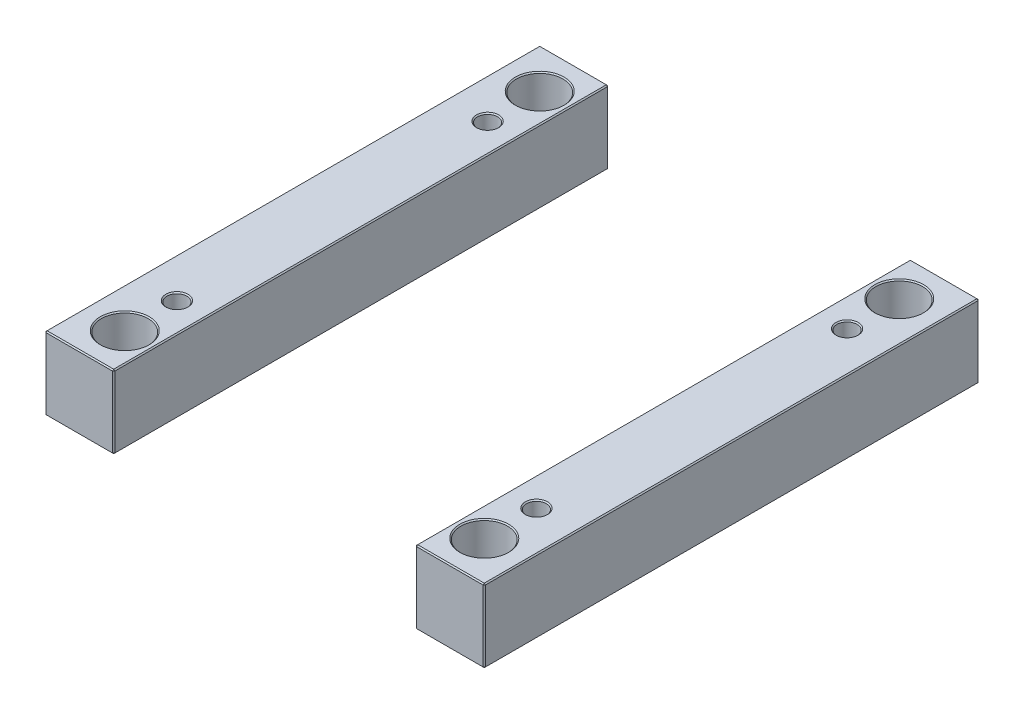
ISO-10303-21;
HEADER;
FILE_DESCRIPTION(('STEP AP214'),'2;1');
FILE_NAME('part.step','',(''),(''),'','','');
FILE_SCHEMA(('AUTOMOTIVE_DESIGN { 1 0 10303 214 1 1 1 1 }'));
ENDSEC;
DATA;
#1=APPLICATION_CONTEXT('core data for automotive mechanical design processes');
#2=APPLICATION_PROTOCOL_DEFINITION('international standard','automotive_design',2000,#1);
#3=PRODUCT_CONTEXT('',#1,'mechanical');
#4=PRODUCT('Part','Part','',(#3));
#5=PRODUCT_RELATED_PRODUCT_CATEGORY('part','',(#4));
#6=PRODUCT_DEFINITION_FORMATION('','',#4);
#7=PRODUCT_DEFINITION_CONTEXT('part definition',#1,'design');
#8=PRODUCT_DEFINITION('design','',#6,#7);
#9=PRODUCT_DEFINITION_SHAPE('','',#8);
#10=(LENGTH_UNIT() NAMED_UNIT(*) SI_UNIT(.MILLI.,.METRE.));
#11=(NAMED_UNIT(*) PLANE_ANGLE_UNIT() SI_UNIT($,.RADIAN.));
#12=(NAMED_UNIT(*) SI_UNIT($,.STERADIAN.) SOLID_ANGLE_UNIT());
#13=UNCERTAINTY_MEASURE_WITH_UNIT(LENGTH_MEASURE(1.E-05),#10,'distance_accuracy_value','');
#14=(GEOMETRIC_REPRESENTATION_CONTEXT(3) GLOBAL_UNCERTAINTY_ASSIGNED_CONTEXT((#13)) GLOBAL_UNIT_ASSIGNED_CONTEXT((#10,
#11,#12)) REPRESENTATION_CONTEXT('',''));
#15=CARTESIAN_POINT('',(0.,0.,0.));
#16=DIRECTION('',(0.,0.,1.));
#17=DIRECTION('',(1.,0.,0.));
#18=AXIS2_PLACEMENT_3D('',#15,#16,#17);
#19=CARTESIAN_POINT('',(-198.,66.,-223.));
#20=DIRECTION('',(0.,0.,1.));
#21=DIRECTION('',(1.,0.,0.));
#22=AXIS2_PLACEMENT_3D('',#19,#20,#21);
#23=PLANE('',#22);
#24=DIRECTION('',(-1.,0.,0.));
#25=VECTOR('',#24,1.);
#26=CARTESIAN_POINT('',(-198.,1.00000000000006,-223.));
#27=LINE('',#26,#25);
#28=CARTESIAN_POINT('',(-137.,1.00000000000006,-223.));
#29=VERTEX_POINT('',#28);
#30=CARTESIAN_POINT('',(-197.,1.00000000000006,-223.));
#31=VERTEX_POINT('',#30);
#32=EDGE_CURVE('P0_E137',#29,#31,#27,.T.);
#33=ORIENTED_EDGE('',*,*,#32,.T.);
#34=DIRECTION('',(0.,1.,0.));
#35=VECTOR('',#34,1.);
#36=CARTESIAN_POINT('',(-197.,66.,-223.));
#37=LINE('',#36,#35);
#38=CARTESIAN_POINT('',(-197.,65.,-223.));
#39=VERTEX_POINT('',#38);
#40=EDGE_CURVE('P0_E265',#31,#39,#37,.T.);
#41=ORIENTED_EDGE('',*,*,#40,.T.);
#42=DIRECTION('',(1.,0.,0.));
#43=VECTOR('',#42,1.);
#44=CARTESIAN_POINT('',(-198.,65.,-223.));
#45=LINE('',#44,#43);
#46=CARTESIAN_POINT('',(-137.,65.,-223.));
#47=VERTEX_POINT('',#46);
#48=EDGE_CURVE('P0_E263',#39,#47,#45,.T.);
#49=ORIENTED_EDGE('',*,*,#48,.T.);
#50=DIRECTION('',(0.,-1.,0.));
#51=VECTOR('',#50,1.);
#52=CARTESIAN_POINT('',(-137.,66.,-223.));
#53=LINE('',#52,#51);
#54=EDGE_CURVE('P0_E260',#47,#29,#53,.T.);
#55=ORIENTED_EDGE('',*,*,#54,.T.);
#56=EDGE_LOOP('',(#33,#41,#49,#55));
#57=FACE_BOUND('',#56,.T.);
#58=ADVANCED_FACE('P0_F16',(#57),#23,.F.);
#59=CARTESIAN_POINT('',(-198.,66.,223.));
#60=DIRECTION('',(1.,0.,0.));
#61=DIRECTION('',(0.,0.,-1.));
#62=AXIS2_PLACEMENT_3D('',#59,#60,#61);
#63=PLANE('',#62);
#64=DIRECTION('',(0.,1.,0.));
#65=VECTOR('',#64,1.);
#66=CARTESIAN_POINT('',(-198.,66.,222.));
#67=LINE('',#66,#65);
#68=CARTESIAN_POINT('',(-198.,1.00000000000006,222.));
#69=VERTEX_POINT('',#68);
#70=CARTESIAN_POINT('',(-198.,65.,222.));
#71=VERTEX_POINT('',#70);
#72=EDGE_CURVE('P0_E253',#69,#71,#67,.T.);
#73=ORIENTED_EDGE('',*,*,#72,.T.);
#74=DIRECTION('',(0.,0.,-1.));
#75=VECTOR('',#74,1.);
#76=CARTESIAN_POINT('',(-198.,65.,223.));
#77=LINE('',#76,#75);
#78=CARTESIAN_POINT('',(-198.,65.,-222.));
#79=VERTEX_POINT('',#78);
#80=EDGE_CURVE('P0_E258',#71,#79,#77,.T.);
#81=ORIENTED_EDGE('',*,*,#80,.T.);
#82=DIRECTION('',(0.,-1.,0.));
#83=VECTOR('',#82,1.);
#84=CARTESIAN_POINT('',(-198.,66.,-222.));
#85=LINE('',#84,#83);
#86=CARTESIAN_POINT('',(-198.,1.00000000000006,-222.));
#87=VERTEX_POINT('',#86);
#88=EDGE_CURVE('P0_E255',#79,#87,#85,.T.);
#89=ORIENTED_EDGE('',*,*,#88,.T.);
#90=DIRECTION('',(0.,0.,1.));
#91=VECTOR('',#90,1.);
#92=CARTESIAN_POINT('',(-198.,1.00000000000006,223.));
#93=LINE('',#92,#91);
#94=EDGE_CURVE('P0_E251',#87,#69,#93,.T.);
#95=ORIENTED_EDGE('',*,*,#94,.T.);
#96=EDGE_LOOP('',(#73,#81,#89,#95));
#97=FACE_BOUND('',#96,.T.);
#98=ADVANCED_FACE('P0_F333',(#97),#63,.F.);
#99=CARTESIAN_POINT('',(-198.,66.,223.));
#100=DIRECTION('',(0.,0.,-1.));
#101=DIRECTION('',(-1.,0.,0.));
#102=AXIS2_PLACEMENT_3D('',#99,#100,#101);
#103=PLANE('',#102);
#104=DIRECTION('',(-1.,0.,0.));
#105=VECTOR('',#104,1.);
#106=CARTESIAN_POINT('',(-198.,65.,223.));
#107=LINE('',#106,#105);
#108=CARTESIAN_POINT('',(-137.,65.,223.));
#109=VERTEX_POINT('',#108);
#110=CARTESIAN_POINT('',(-197.,65.,223.));
#111=VERTEX_POINT('',#110);
#112=EDGE_CURVE('P0_E272',#109,#111,#107,.T.);
#113=ORIENTED_EDGE('',*,*,#112,.T.);
#114=DIRECTION('',(0.,-1.,0.));
#115=VECTOR('',#114,1.);
#116=CARTESIAN_POINT('',(-197.,66.,223.));
#117=LINE('',#116,#115);
#118=CARTESIAN_POINT('',(-197.,1.00000000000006,223.));
#119=VERTEX_POINT('',#118);
#120=EDGE_CURVE('P0_E274',#111,#119,#117,.T.);
#121=ORIENTED_EDGE('',*,*,#120,.T.);
#122=DIRECTION('',(1.,0.,0.));
#123=VECTOR('',#122,1.);
#124=CARTESIAN_POINT('',(-136.,1.00000000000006,223.));
#125=LINE('',#124,#123);
#126=CARTESIAN_POINT('',(-137.,1.00000000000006,223.));
#127=VERTEX_POINT('',#126);
#128=EDGE_CURVE('P0_E270',#119,#127,#125,.T.);
#129=ORIENTED_EDGE('',*,*,#128,.T.);
#130=DIRECTION('',(0.,1.,0.));
#131=VECTOR('',#130,1.);
#132=CARTESIAN_POINT('',(-137.,66.,223.));
#133=LINE('',#132,#131);
#134=EDGE_CURVE('P0_E268',#127,#109,#133,.T.);
#135=ORIENTED_EDGE('',*,*,#134,.T.);
#136=EDGE_LOOP('',(#113,#121,#129,#135));
#137=FACE_BOUND('',#136,.T.);
#138=ADVANCED_FACE('P0_F372',(#137),#103,.F.);
#139=CARTESIAN_POINT('',(-136.,66.,-223.));
#140=DIRECTION('',(-1.,0.,0.));
#141=DIRECTION('',(0.,0.,1.));
#142=AXIS2_PLACEMENT_3D('',#139,#140,#141);
#143=PLANE('',#142);
#144=DIRECTION('',(0.,0.,1.));
#145=VECTOR('',#144,1.);
#146=CARTESIAN_POINT('',(-136.,65.,-223.));
#147=LINE('',#146,#145);
#148=CARTESIAN_POINT('',(-136.,65.,-222.));
#149=VERTEX_POINT('',#148);
#150=CARTESIAN_POINT('',(-136.,65.,222.));
#151=VERTEX_POINT('',#150);
#152=EDGE_CURVE('P0_E31',#149,#151,#147,.T.);
#153=ORIENTED_EDGE('',*,*,#152,.T.);
#154=DIRECTION('',(0.,-1.,0.));
#155=VECTOR('',#154,1.);
#156=CARTESIAN_POINT('',(-136.,66.,222.));
#157=LINE('',#156,#155);
#158=CARTESIAN_POINT('',(-136.,1.00000000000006,222.));
#159=VERTEX_POINT('',#158);
#160=EDGE_CURVE('P0_E190',#151,#159,#157,.T.);
#161=ORIENTED_EDGE('',*,*,#160,.T.);
#162=DIRECTION('',(0.,0.,-1.));
#163=VECTOR('',#162,1.);
#164=CARTESIAN_POINT('',(-136.,1.00000000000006,-223.));
#165=LINE('',#164,#163);
#166=CARTESIAN_POINT('',(-136.,1.00000000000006,-222.));
#167=VERTEX_POINT('',#166);
#168=EDGE_CURVE('P0_E286',#159,#167,#165,.T.);
#169=ORIENTED_EDGE('',*,*,#168,.T.);
#170=DIRECTION('',(0.,1.,0.));
#171=VECTOR('',#170,1.);
#172=CARTESIAN_POINT('',(-136.,66.,-222.));
#173=LINE('',#172,#171);
#174=EDGE_CURVE('P0_E36',#167,#149,#173,.T.);
#175=ORIENTED_EDGE('',*,*,#174,.T.);
#176=EDGE_LOOP('',(#153,#161,#169,#175));
#177=FACE_BOUND('',#176,.T.);
#178=ADVANCED_FACE('P0_F649',(#177),#143,.F.);
#179=CARTESIAN_POINT('',(0.,66.,0.));
#180=DIRECTION('',(0.,-1.,0.));
#181=DIRECTION('',(0.,0.,-1.));
#182=AXIS2_PLACEMENT_3D('',#179,#180,#181);
#183=PLANE('',#182);
#184=CARTESIAN_POINT('',(-162.,66.,-187.));
#185=DIRECTION('',(0.,-1.,0.));
#186=DIRECTION('',(0.,0.,-1.));
#187=AXIS2_PLACEMENT_3D('',#184,#185,#186);
#188=CIRCLE('',#187,22.);
#189=CARTESIAN_POINT('',(-162.,66.,-209.));
#190=VERTEX_POINT('',#189);
#191=EDGE_CURVE('P0_E214',#190,#190,#188,.T.);
#192=ORIENTED_EDGE('',*,*,#191,.T.);
#193=EDGE_LOOP('',(#192));
#194=FACE_BOUND('',#193,.T.);
#195=CARTESIAN_POINT('',(-162.,66.,187.));
#196=DIRECTION('',(0.,-1.,0.));
#197=DIRECTION('',(0.,0.,-1.));
#198=AXIS2_PLACEMENT_3D('',#195,#196,#197);
#199=CIRCLE('',#198,22.);
#200=CARTESIAN_POINT('',(-162.,66.,165.));
#201=VERTEX_POINT('',#200);
#202=EDGE_CURVE('P0_E211',#201,#201,#199,.T.);
#203=ORIENTED_EDGE('',*,*,#202,.T.);
#204=EDGE_LOOP('',(#203));
#205=FACE_BOUND('',#204,.T.);
#206=CARTESIAN_POINT('',(-162.,66.,140.));
#207=DIRECTION('',(0.,-1.,0.));
#208=DIRECTION('',(0.,0.,-1.));
#209=AXIS2_PLACEMENT_3D('',#206,#207,#208);
#210=CIRCLE('',#209,10.);
#211=CARTESIAN_POINT('',(-162.,66.,130.));
#212=VERTEX_POINT('',#211);
#213=EDGE_CURVE('P0_E193',#212,#212,#210,.T.);
#214=ORIENTED_EDGE('',*,*,#213,.T.);
#215=EDGE_LOOP('',(#214));
#216=FACE_BOUND('',#215,.T.);
#217=CARTESIAN_POINT('',(-162.,66.,-140.));
#218=DIRECTION('',(0.,-1.,0.));
#219=DIRECTION('',(0.,0.,-1.));
#220=AXIS2_PLACEMENT_3D('',#217,#218,#219);
#221=CIRCLE('',#220,10.);
#222=CARTESIAN_POINT('',(-162.,66.,-150.));
#223=VERTEX_POINT('',#222);
#224=EDGE_CURVE('P0_E189',#223,#223,#221,.T.);
#225=ORIENTED_EDGE('',*,*,#224,.T.);
#226=EDGE_LOOP('',(#225));
#227=FACE_BOUND('',#226,.T.);
#228=DIRECTION('',(0.,0.,1.));
#229=VECTOR('',#228,1.);
#230=CARTESIAN_POINT('',(-197.,66.,0.));
#231=LINE('',#230,#229);
#232=CARTESIAN_POINT('',(-197.,66.,-222.));
#233=VERTEX_POINT('',#232);
#234=CARTESIAN_POINT('',(-197.,66.,222.));
#235=VERTEX_POINT('',#234);
#236=EDGE_CURVE('P0_E281',#233,#235,#231,.T.);
#237=ORIENTED_EDGE('',*,*,#236,.T.);
#238=DIRECTION('',(1.,0.,0.));
#239=VECTOR('',#238,1.);
#240=CARTESIAN_POINT('',(0.,66.,222.));
#241=LINE('',#240,#239);
#242=CARTESIAN_POINT('',(-137.,66.,222.));
#243=VERTEX_POINT('',#242);
#244=EDGE_CURVE('P0_E283',#235,#243,#241,.T.);
#245=ORIENTED_EDGE('',*,*,#244,.T.);
#246=DIRECTION('',(0.,0.,-1.));
#247=VECTOR('',#246,1.);
#248=CARTESIAN_POINT('',(-137.,66.,0.));
#249=LINE('',#248,#247);
#250=CARTESIAN_POINT('',(-137.,66.,-222.));
#251=VERTEX_POINT('',#250);
#252=EDGE_CURVE('P0_E277',#243,#251,#249,.T.);
#253=ORIENTED_EDGE('',*,*,#252,.T.);
#254=DIRECTION('',(-1.,0.,0.));
#255=VECTOR('',#254,1.);
#256=CARTESIAN_POINT('',(0.,66.,-222.));
#257=LINE('',#256,#255);
#258=EDGE_CURVE('P0_E279',#251,#233,#257,.T.);
#259=ORIENTED_EDGE('',*,*,#258,.T.);
#260=EDGE_LOOP('',(#237,#245,#253,#259));
#261=FACE_BOUND('',#260,.T.);
#262=ADVANCED_FACE('P0_F229',(#194,#205,#216,#227,#261),#183,.F.);
#263=CARTESIAN_POINT('',(0.,0.,0.));
#264=DIRECTION('',(0.,-1.,0.));
#265=DIRECTION('',(0.,0.,-1.));
#266=AXIS2_PLACEMENT_3D('',#263,#264,#265);
#267=PLANE('',#266);
#268=CARTESIAN_POINT('',(-162.,0.,-187.));
#269=DIRECTION('',(0.,-1.,0.));
#270=DIRECTION('',(0.,0.,-1.));
#271=AXIS2_PLACEMENT_3D('',#268,#269,#270);
#272=CIRCLE('',#271,22.);
#273=CARTESIAN_POINT('',(-162.,0.,-209.));
#274=VERTEX_POINT('',#273);
#275=EDGE_CURVE('P0_E202',#274,#274,#272,.F.);
#276=ORIENTED_EDGE('',*,*,#275,.T.);
#277=EDGE_LOOP('',(#276));
#278=FACE_BOUND('',#277,.T.);
#279=CARTESIAN_POINT('',(-162.,0.,187.));
#280=DIRECTION('',(0.,-1.,0.));
#281=DIRECTION('',(0.,0.,-1.));
#282=AXIS2_PLACEMENT_3D('',#279,#280,#281);
#283=CIRCLE('',#282,22.);
#284=CARTESIAN_POINT('',(-162.,0.,165.));
#285=VERTEX_POINT('',#284);
#286=EDGE_CURVE('P0_E199',#285,#285,#283,.F.);
#287=ORIENTED_EDGE('',*,*,#286,.T.);
#288=EDGE_LOOP('',(#287));
#289=FACE_BOUND('',#288,.T.);
#290=CARTESIAN_POINT('',(-162.,0.,-140.));
#291=DIRECTION('',(0.,-1.,0.));
#292=DIRECTION('',(0.,0.,-1.));
#293=AXIS2_PLACEMENT_3D('',#290,#291,#292);
#294=CIRCLE('',#293,10.);
#295=CARTESIAN_POINT('',(-162.,0.,-150.));
#296=VERTEX_POINT('',#295);
#297=EDGE_CURVE('P0_E235',#296,#296,#294,.F.);
#298=ORIENTED_EDGE('',*,*,#297,.T.);
#299=EDGE_LOOP('',(#298));
#300=FACE_BOUND('',#299,.T.);
#301=CARTESIAN_POINT('',(-162.,0.,140.));
#302=DIRECTION('',(0.,-1.,0.));
#303=DIRECTION('',(0.,0.,-1.));
#304=AXIS2_PLACEMENT_3D('',#301,#302,#303);
#305=CIRCLE('',#304,10.);
#306=CARTESIAN_POINT('',(-162.,0.,130.));
#307=VERTEX_POINT('',#306);
#308=EDGE_CURVE('P0_E238',#307,#307,#305,.F.);
#309=ORIENTED_EDGE('',*,*,#308,.T.);
#310=EDGE_LOOP('',(#309));
#311=FACE_BOUND('',#310,.T.);
#312=DIRECTION('',(-1.,0.,0.));
#313=VECTOR('',#312,1.);
#314=CARTESIAN_POINT('',(-198.,0.,222.));
#315=LINE('',#314,#313);
#316=CARTESIAN_POINT('',(-137.,0.,222.));
#317=VERTEX_POINT('',#316);
#318=CARTESIAN_POINT('',(-197.,0.,222.));
#319=VERTEX_POINT('',#318);
#320=EDGE_CURVE('P0_E114',#317,#319,#315,.T.);
#321=ORIENTED_EDGE('',*,*,#320,.T.);
#322=DIRECTION('',(0.,0.,-1.));
#323=VECTOR('',#322,1.);
#324=CARTESIAN_POINT('',(-197.,0.,-223.));
#325=LINE('',#324,#323);
#326=CARTESIAN_POINT('',(-197.,0.,-222.));
#327=VERTEX_POINT('',#326);
#328=EDGE_CURVE('P0_E110',#319,#327,#325,.T.);
#329=ORIENTED_EDGE('',*,*,#328,.T.);
#330=DIRECTION('',(1.,0.,0.));
#331=VECTOR('',#330,1.);
#332=CARTESIAN_POINT('',(-136.,0.,-222.));
#333=LINE('',#332,#331);
#334=CARTESIAN_POINT('',(-137.,0.,-222.));
#335=VERTEX_POINT('',#334);
#336=EDGE_CURVE('P0_E104',#327,#335,#333,.T.);
#337=ORIENTED_EDGE('',*,*,#336,.T.);
#338=DIRECTION('',(0.,0.,1.));
#339=VECTOR('',#338,1.);
#340=CARTESIAN_POINT('',(-137.,0.,223.));
#341=LINE('',#340,#339);
#342=EDGE_CURVE('P0_E107',#335,#317,#341,.T.);
#343=ORIENTED_EDGE('',*,*,#342,.T.);
#344=EDGE_LOOP('',(#321,#329,#337,#343));
#345=FACE_BOUND('',#344,.T.);
#346=ADVANCED_FACE('P0_F106',(#278,#289,#300,#311,#345),#267,.T.);
#347=CARTESIAN_POINT('',(-162.,0.,-140.));
#348=DIRECTION('',(0.,1.,0.));
#349=DIRECTION('',(0.,0.,1.));
#350=AXIS2_PLACEMENT_3D('',#347,#348,#349);
#351=CYLINDRICAL_SURFACE('',#350,9.);
#352=CARTESIAN_POINT('',(-162.,65.,-140.));
#353=DIRECTION('',(0.,-1.,0.));
#354=DIRECTION('',(0.,0.,-1.));
#355=AXIS2_PLACEMENT_3D('',#352,#353,#354);
#356=CIRCLE('',#355,9.);
#357=CARTESIAN_POINT('',(-162.,65.,-149.));
#358=VERTEX_POINT('',#357);
#359=EDGE_CURVE('P0_E196',#358,#358,#356,.F.);
#360=ORIENTED_EDGE('',*,*,#359,.T.);
#361=EDGE_LOOP('',(#360));
#362=FACE_BOUND('',#361,.T.);
#363=CARTESIAN_POINT('',(-162.,0.999999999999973,-140.));
#364=DIRECTION('',(0.,-1.,0.));
#365=DIRECTION('',(0.,0.,-1.));
#366=AXIS2_PLACEMENT_3D('',#363,#364,#365);
#367=CIRCLE('',#366,9.);
#368=CARTESIAN_POINT('',(-162.,0.999999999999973,-149.));
#369=VERTEX_POINT('',#368);
#370=EDGE_CURVE('P0_E241',#369,#369,#367,.T.);
#371=ORIENTED_EDGE('',*,*,#370,.T.);
#372=EDGE_LOOP('',(#371));
#373=FACE_BOUND('',#372,.T.);
#374=ADVANCED_FACE('P0_F228',(#362,#373),#351,.F.);
#375=CARTESIAN_POINT('',(-162.,0.,140.));
#376=DIRECTION('',(0.,1.,0.));
#377=DIRECTION('',(0.,0.,1.));
#378=AXIS2_PLACEMENT_3D('',#375,#376,#377);
#379=CYLINDRICAL_SURFACE('',#378,9.);
#380=CARTESIAN_POINT('',(-162.,65.,140.));
#381=DIRECTION('',(0.,-1.,0.));
#382=DIRECTION('',(0.,0.,-1.));
#383=AXIS2_PLACEMENT_3D('',#380,#381,#382);
#384=CIRCLE('',#383,9.);
#385=CARTESIAN_POINT('',(-162.,65.,131.));
#386=VERTEX_POINT('',#385);
#387=EDGE_CURVE('P0_E186',#386,#386,#384,.F.);
#388=ORIENTED_EDGE('',*,*,#387,.T.);
#389=EDGE_LOOP('',(#388));
#390=FACE_BOUND('',#389,.T.);
#391=CARTESIAN_POINT('',(-162.,0.999999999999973,140.));
#392=DIRECTION('',(0.,-1.,0.));
#393=DIRECTION('',(0.,0.,-1.));
#394=AXIS2_PLACEMENT_3D('',#391,#392,#393);
#395=CIRCLE('',#394,9.);
#396=CARTESIAN_POINT('',(-162.,0.999999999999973,131.));
#397=VERTEX_POINT('',#396);
#398=EDGE_CURVE('P0_E248',#397,#397,#395,.T.);
#399=ORIENTED_EDGE('',*,*,#398,.T.);
#400=EDGE_LOOP('',(#399));
#401=FACE_BOUND('',#400,.T.);
#402=ADVANCED_FACE('P0_F380',(#390,#401),#379,.F.);
#403=CARTESIAN_POINT('',(-162.,0.,-140.));
#404=DIRECTION('',(0.,-1.,0.));
#405=DIRECTION('',(0.,0.,-1.));
#406=AXIS2_PLACEMENT_3D('',#403,#404,#405);
#407=CONICAL_SURFACE('',#406,10.,0.785398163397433);
#408=ORIENTED_EDGE('',*,*,#370,.F.);
#409=EDGE_LOOP('',(#408));
#410=FACE_BOUND('',#409,.T.);
#411=ORIENTED_EDGE('',*,*,#297,.F.);
#412=EDGE_LOOP('',(#411));
#413=FACE_BOUND('',#412,.T.);
#414=ADVANCED_FACE('P0_F376',(#410,#413),#407,.F.);
#415=CARTESIAN_POINT('',(-162.,0.,140.));
#416=DIRECTION('',(0.,-1.,0.));
#417=DIRECTION('',(0.,0.,-1.));
#418=AXIS2_PLACEMENT_3D('',#415,#416,#417);
#419=CONICAL_SURFACE('',#418,10.,0.785398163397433);
#420=ORIENTED_EDGE('',*,*,#398,.F.);
#421=EDGE_LOOP('',(#420));
#422=FACE_BOUND('',#421,.T.);
#423=ORIENTED_EDGE('',*,*,#308,.F.);
#424=EDGE_LOOP('',(#423));
#425=FACE_BOUND('',#424,.T.);
#426=ADVANCED_FACE('P0_F379',(#422,#425),#419,.F.);
#427=CARTESIAN_POINT('',(-136.,66.,222.));
#428=DIRECTION('',(-0.707106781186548,0.,-0.707106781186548));
#429=DIRECTION('',(0.,-1.,0.));
#430=AXIS2_PLACEMENT_3D('',#427,#428,#429);
#431=PLANE('',#430);
#432=DIRECTION('',(-0.707106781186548,0.,0.707106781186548));
#433=VECTOR('',#432,1.);
#434=CARTESIAN_POINT('',(-136.5,65.,222.5));
#435=LINE('',#434,#433);
#436=EDGE_CURVE('P0_E125',#109,#151,#435,.F.);
#437=ORIENTED_EDGE('',*,*,#436,.F.);
#438=ORIENTED_EDGE('',*,*,#134,.F.);
#439=DIRECTION('',(0.707106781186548,0.,-0.707106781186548));
#440=VECTOR('',#439,1.);
#441=CARTESIAN_POINT('',(-137.,1.00000000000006,223.));
#442=LINE('',#441,#440);
#443=EDGE_CURVE('P0_E181',#159,#127,#442,.F.);
#444=ORIENTED_EDGE('',*,*,#443,.F.);
#445=ORIENTED_EDGE('',*,*,#160,.F.);
#446=EDGE_LOOP('',(#437,#438,#444,#445));
#447=FACE_BOUND('',#446,.T.);
#448=ADVANCED_FACE('P0_F384',(#447),#431,.F.);
#449=CARTESIAN_POINT('',(-137.,66.,222.));
#450=DIRECTION('',(0.577350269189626,0.577350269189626,0.577350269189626));
#451=DIRECTION('',(0.707106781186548,0.,-0.707106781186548));
#452=AXIS2_PLACEMENT_3D('',#449,#450,#451);
#453=PLANE('',#452);
#454=DIRECTION('',(0.,0.707106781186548,-0.707106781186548));
#455=VECTOR('',#454,1.);
#456=CARTESIAN_POINT('',(-137.,66.,222.));
#457=LINE('',#456,#455);
#458=EDGE_CURVE('P0_E175',#109,#243,#457,.T.);
#459=ORIENTED_EDGE('',*,*,#458,.F.);
#460=ORIENTED_EDGE('',*,*,#436,.T.);
#461=DIRECTION('',(0.707106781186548,-0.707106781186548,0.));
#462=VECTOR('',#461,1.);
#463=CARTESIAN_POINT('',(-137.,66.,222.));
#464=LINE('',#463,#462);
#465=EDGE_CURVE('P0_E178',#243,#151,#464,.T.);
#466=ORIENTED_EDGE('',*,*,#465,.F.);
#467=EDGE_LOOP('',(#459,#460,#466));
#468=FACE_BOUND('',#467,.T.);
#469=ADVANCED_FACE('P0_F588',(#468),#453,.T.);
#470=CARTESIAN_POINT('',(-137.,1.00000000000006,223.));
#471=DIRECTION('',(0.577350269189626,-0.577350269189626,0.577350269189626));
#472=DIRECTION('',(0.707106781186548,0.,-0.707106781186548));
#473=AXIS2_PLACEMENT_3D('',#470,#471,#472);
#474=PLANE('',#473);
#475=DIRECTION('',(0.707106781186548,0.707106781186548,0.));
#476=VECTOR('',#475,1.);
#477=CARTESIAN_POINT('',(-136.5,0.500000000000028,222.));
#478=LINE('',#477,#476);
#479=EDGE_CURVE('P0_E123',#159,#317,#478,.F.);
#480=ORIENTED_EDGE('',*,*,#479,.F.);
#481=ORIENTED_EDGE('',*,*,#443,.T.);
#482=DIRECTION('',(0.,-0.707106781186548,-0.707106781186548));
#483=VECTOR('',#482,1.);
#484=CARTESIAN_POINT('',(-137.,1.00000000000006,223.));
#485=LINE('',#484,#483);
#486=EDGE_CURVE('P0_E172',#317,#127,#485,.F.);
#487=ORIENTED_EDGE('',*,*,#486,.F.);
#488=EDGE_LOOP('',(#480,#481,#487));
#489=FACE_BOUND('',#488,.T.);
#490=ADVANCED_FACE('P0_F597',(#489),#474,.T.);
#491=CARTESIAN_POINT('',(-137.,66.,0.));
#492=DIRECTION('',(-0.707106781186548,-0.707106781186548,0.));
#493=DIRECTION('',(0.,0.,-1.));
#494=AXIS2_PLACEMENT_3D('',#491,#492,#493);
#495=PLANE('',#494);
#496=ORIENTED_EDGE('',*,*,#465,.T.);
#497=ORIENTED_EDGE('',*,*,#152,.F.);
#498=DIRECTION('',(-0.707106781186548,0.707106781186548,0.));
#499=VECTOR('',#498,1.);
#500=CARTESIAN_POINT('',(-136.5,65.5,-222.));
#501=LINE('',#500,#499);
#502=EDGE_CURVE('P0_E165',#251,#149,#501,.F.);
#503=ORIENTED_EDGE('',*,*,#502,.F.);
#504=ORIENTED_EDGE('',*,*,#252,.F.);
#505=EDGE_LOOP('',(#496,#497,#503,#504));
#506=FACE_BOUND('',#505,.T.);
#507=ADVANCED_FACE('P0_F349',(#506),#495,.F.);
#508=CARTESIAN_POINT('',(0.,66.,222.));
#509=DIRECTION('',(0.,-0.707106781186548,-0.707106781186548));
#510=DIRECTION('',(1.,0.,0.));
#511=AXIS2_PLACEMENT_3D('',#508,#509,#510);
#512=PLANE('',#511);
#513=ORIENTED_EDGE('',*,*,#458,.T.);
#514=ORIENTED_EDGE('',*,*,#244,.F.);
#515=DIRECTION('',(0.,-0.707106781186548,0.707106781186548));
#516=VECTOR('',#515,1.);
#517=CARTESIAN_POINT('',(-197.,65.5,222.5));
#518=LINE('',#517,#516);
#519=EDGE_CURVE('P0_E162',#111,#235,#518,.F.);
#520=ORIENTED_EDGE('',*,*,#519,.F.);
#521=ORIENTED_EDGE('',*,*,#112,.F.);
#522=EDGE_LOOP('',(#513,#514,#520,#521));
#523=FACE_BOUND('',#522,.T.);
#524=ADVANCED_FACE('P0_F344',(#523),#512,.F.);
#525=CARTESIAN_POINT('',(-197.,66.,223.));
#526=DIRECTION('',(0.707106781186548,0.,-0.707106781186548));
#527=DIRECTION('',(0.,-1.,0.));
#528=AXIS2_PLACEMENT_3D('',#525,#526,#527);
#529=PLANE('',#528);
#530=DIRECTION('',(0.707106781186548,0.,0.707106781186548));
#531=VECTOR('',#530,1.);
#532=CARTESIAN_POINT('',(-197.,1.00000000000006,223.));
#533=LINE('',#532,#531);
#534=EDGE_CURVE('P0_E156',#119,#69,#533,.F.);
#535=ORIENTED_EDGE('',*,*,#534,.F.);
#536=ORIENTED_EDGE('',*,*,#120,.F.);
#537=DIRECTION('',(-0.707106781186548,0.,-0.707106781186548));
#538=VECTOR('',#537,1.);
#539=CARTESIAN_POINT('',(-198.,65.,222.));
#540=LINE('',#539,#538);
#541=EDGE_CURVE('P0_E159',#71,#111,#540,.F.);
#542=ORIENTED_EDGE('',*,*,#541,.F.);
#543=ORIENTED_EDGE('',*,*,#72,.F.);
#544=EDGE_LOOP('',(#535,#536,#542,#543));
#545=FACE_BOUND('',#544,.T.);
#546=ADVANCED_FACE('P0_F338',(#545),#529,.F.);
#547=CARTESIAN_POINT('',(-198.,1.00000000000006,223.));
#548=DIRECTION('',(0.,-0.707106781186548,0.707106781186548));
#549=DIRECTION('',(-1.,0.,0.));
#550=AXIS2_PLACEMENT_3D('',#547,#548,#549);
#551=PLANE('',#550);
#552=ORIENTED_EDGE('',*,*,#486,.T.);
#553=ORIENTED_EDGE('',*,*,#128,.F.);
#554=DIRECTION('',(0.,0.707106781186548,0.707106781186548));
#555=VECTOR('',#554,1.);
#556=CARTESIAN_POINT('',(-197.,1.00000000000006,223.));
#557=LINE('',#556,#555);
#558=EDGE_CURVE('P0_E134',#319,#119,#557,.T.);
#559=ORIENTED_EDGE('',*,*,#558,.F.);
#560=ORIENTED_EDGE('',*,*,#320,.F.);
#561=EDGE_LOOP('',(#552,#553,#559,#560));
#562=FACE_BOUND('',#561,.T.);
#563=ADVANCED_FACE('P0_F364',(#562),#551,.T.);
#564=CARTESIAN_POINT('',(-136.,1.00000000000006,-223.));
#565=DIRECTION('',(0.707106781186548,-0.707106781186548,0.));
#566=DIRECTION('',(0.,0.,1.));
#567=AXIS2_PLACEMENT_3D('',#564,#565,#566);
#568=PLANE('',#567);
#569=ORIENTED_EDGE('',*,*,#479,.T.);
#570=ORIENTED_EDGE('',*,*,#342,.F.);
#571=DIRECTION('',(-0.707106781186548,-0.707106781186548,0.));
#572=VECTOR('',#571,1.);
#573=CARTESIAN_POINT('',(-137.,0.,-222.));
#574=LINE('',#573,#572);
#575=EDGE_CURVE('P0_E120',#167,#335,#574,.T.);
#576=ORIENTED_EDGE('',*,*,#575,.F.);
#577=ORIENTED_EDGE('',*,*,#168,.F.);
#578=EDGE_LOOP('',(#569,#570,#576,#577));
#579=FACE_BOUND('',#578,.T.);
#580=ADVANCED_FACE('P0_F119',(#579),#568,.T.);
#581=CARTESIAN_POINT('',(-137.,66.,-223.));
#582=DIRECTION('',(-0.707106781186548,0.,0.707106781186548));
#583=DIRECTION('',(0.,-1.,0.));
#584=AXIS2_PLACEMENT_3D('',#581,#582,#583);
#585=PLANE('',#584);
#586=DIRECTION('',(0.707106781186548,0.,0.707106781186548));
#587=VECTOR('',#586,1.);
#588=CARTESIAN_POINT('',(-137.,65.,-223.));
#589=LINE('',#588,#587);
#590=EDGE_CURVE('P0_E168',#149,#47,#589,.F.);
#591=ORIENTED_EDGE('',*,*,#590,.F.);
#592=ORIENTED_EDGE('',*,*,#174,.F.);
#593=DIRECTION('',(-0.707106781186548,0.,-0.707106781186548));
#594=VECTOR('',#593,1.);
#595=CARTESIAN_POINT('',(-136.5,1.00000000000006,-222.5));
#596=LINE('',#595,#594);
#597=EDGE_CURVE('P0_E133',#29,#167,#596,.F.);
#598=ORIENTED_EDGE('',*,*,#597,.F.);
#599=ORIENTED_EDGE('',*,*,#54,.F.);
#600=EDGE_LOOP('',(#591,#592,#598,#599));
#601=FACE_BOUND('',#600,.T.);
#602=ADVANCED_FACE('P0_F354',(#601),#585,.F.);
#603=CARTESIAN_POINT('',(-137.,65.,-223.));
#604=DIRECTION('',(0.577350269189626,0.577350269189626,-0.577350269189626));
#605=DIRECTION('',(-0.707106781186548,0.,-0.707106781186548));
#606=AXIS2_PLACEMENT_3D('',#603,#604,#605);
#607=PLANE('',#606);
#608=ORIENTED_EDGE('',*,*,#502,.T.);
#609=ORIENTED_EDGE('',*,*,#590,.T.);
#610=DIRECTION('',(0.,-0.707106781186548,-0.707106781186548));
#611=VECTOR('',#610,1.);
#612=CARTESIAN_POINT('',(-137.,65.,-223.));
#613=LINE('',#612,#611);
#614=EDGE_CURVE('P0_E151',#251,#47,#613,.T.);
#615=ORIENTED_EDGE('',*,*,#614,.F.);
#616=EDGE_LOOP('',(#608,#609,#615));
#617=FACE_BOUND('',#616,.T.);
#618=ADVANCED_FACE('P0_F352',(#617),#607,.T.);
#619=CARTESIAN_POINT('',(-198.,65.,222.));
#620=DIRECTION('',(-0.577350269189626,0.577350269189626,0.577350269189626));
#621=DIRECTION('',(0.707106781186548,0.,0.707106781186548));
#622=AXIS2_PLACEMENT_3D('',#619,#620,#621);
#623=PLANE('',#622);
#624=ORIENTED_EDGE('',*,*,#541,.T.);
#625=ORIENTED_EDGE('',*,*,#519,.T.);
#626=DIRECTION('',(0.707106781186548,0.707106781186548,0.));
#627=VECTOR('',#626,1.);
#628=CARTESIAN_POINT('',(-198.,65.,222.));
#629=LINE('',#628,#627);
#630=EDGE_CURVE('P0_E142',#71,#235,#629,.T.);
#631=ORIENTED_EDGE('',*,*,#630,.F.);
#632=EDGE_LOOP('',(#624,#625,#631));
#633=FACE_BOUND('',#632,.T.);
#634=ADVANCED_FACE('P0_F341',(#633),#623,.T.);
#635=CARTESIAN_POINT('',(-197.,1.00000000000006,223.));
#636=DIRECTION('',(-0.577350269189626,-0.577350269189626,0.577350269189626));
#637=DIRECTION('',(0.707106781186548,0.,0.707106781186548));
#638=AXIS2_PLACEMENT_3D('',#635,#636,#637);
#639=PLANE('',#638);
#640=ORIENTED_EDGE('',*,*,#558,.T.);
#641=ORIENTED_EDGE('',*,*,#534,.T.);
#642=DIRECTION('',(0.707106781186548,-0.707106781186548,0.));
#643=VECTOR('',#642,1.);
#644=CARTESIAN_POINT('',(-197.5,0.500000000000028,222.));
#645=LINE('',#644,#643);
#646=EDGE_CURVE('P0_E138',#319,#69,#645,.F.);
#647=ORIENTED_EDGE('',*,*,#646,.F.);
#648=EDGE_LOOP('',(#640,#641,#647));
#649=FACE_BOUND('',#648,.T.);
#650=ADVANCED_FACE('P0_F403',(#649),#639,.T.);
#651=CARTESIAN_POINT('',(-137.,0.,-222.));
#652=DIRECTION('',(0.577350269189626,-0.577350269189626,-0.577350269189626));
#653=DIRECTION('',(-0.707106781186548,0.,-0.707106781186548));
#654=AXIS2_PLACEMENT_3D('',#651,#652,#653);
#655=PLANE('',#654);
#656=ORIENTED_EDGE('',*,*,#597,.T.);
#657=ORIENTED_EDGE('',*,*,#575,.T.);
#658=DIRECTION('',(0.,0.707106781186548,-0.707106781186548));
#659=VECTOR('',#658,1.);
#660=CARTESIAN_POINT('',(-137.,0.,-222.));
#661=LINE('',#660,#659);
#662=EDGE_CURVE('P0_E130',#29,#335,#661,.F.);
#663=ORIENTED_EDGE('',*,*,#662,.F.);
#664=EDGE_LOOP('',(#656,#657,#663));
#665=FACE_BOUND('',#664,.T.);
#666=ADVANCED_FACE('P0_F129',(#665),#655,.T.);
#667=CARTESIAN_POINT('',(0.,66.,-222.));
#668=DIRECTION('',(0.,-0.707106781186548,0.707106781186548));
#669=DIRECTION('',(-1.,0.,0.));
#670=AXIS2_PLACEMENT_3D('',#667,#668,#669);
#671=PLANE('',#670);
#672=ORIENTED_EDGE('',*,*,#614,.T.);
#673=ORIENTED_EDGE('',*,*,#48,.F.);
#674=DIRECTION('',(0.,0.707106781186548,0.707106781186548));
#675=VECTOR('',#674,1.);
#676=CARTESIAN_POINT('',(-197.,65.,-223.));
#677=LINE('',#676,#675);
#678=EDGE_CURVE('P0_E139',#233,#39,#677,.F.);
#679=ORIENTED_EDGE('',*,*,#678,.F.);
#680=ORIENTED_EDGE('',*,*,#258,.F.);
#681=EDGE_LOOP('',(#672,#673,#679,#680));
#682=FACE_BOUND('',#681,.T.);
#683=ADVANCED_FACE('P0_F316',(#682),#671,.F.);
#684=CARTESIAN_POINT('',(-197.,66.,0.));
#685=DIRECTION('',(0.707106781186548,-0.707106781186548,0.));
#686=DIRECTION('',(0.,0.,1.));
#687=AXIS2_PLACEMENT_3D('',#684,#685,#686);
#688=PLANE('',#687);
#689=ORIENTED_EDGE('',*,*,#630,.T.);
#690=ORIENTED_EDGE('',*,*,#236,.F.);
#691=DIRECTION('',(-0.707106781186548,-0.707106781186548,0.));
#692=VECTOR('',#691,1.);
#693=CARTESIAN_POINT('',(-197.5,65.5,-222.));
#694=LINE('',#693,#692);
#695=EDGE_CURVE('P0_E145',#79,#233,#694,.F.);
#696=ORIENTED_EDGE('',*,*,#695,.F.);
#697=ORIENTED_EDGE('',*,*,#80,.F.);
#698=EDGE_LOOP('',(#689,#690,#696,#697));
#699=FACE_BOUND('',#698,.T.);
#700=ADVANCED_FACE('P0_F310',(#699),#688,.F.);
#701=CARTESIAN_POINT('',(-198.,1.00000000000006,223.));
#702=DIRECTION('',(-0.707106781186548,-0.707106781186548,0.));
#703=DIRECTION('',(0.,0.,-1.));
#704=AXIS2_PLACEMENT_3D('',#701,#702,#703);
#705=PLANE('',#704);
#706=ORIENTED_EDGE('',*,*,#646,.T.);
#707=ORIENTED_EDGE('',*,*,#94,.F.);
#708=DIRECTION('',(-0.707106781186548,0.707106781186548,0.));
#709=VECTOR('',#708,1.);
#710=CARTESIAN_POINT('',(-198.,1.00000000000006,-222.));
#711=LINE('',#710,#709);
#712=EDGE_CURVE('P0_E297',#327,#87,#711,.T.);
#713=ORIENTED_EDGE('',*,*,#712,.F.);
#714=ORIENTED_EDGE('',*,*,#328,.F.);
#715=EDGE_LOOP('',(#706,#707,#713,#714));
#716=FACE_BOUND('',#715,.T.);
#717=ADVANCED_FACE('P0_F329',(#716),#705,.T.);
#718=CARTESIAN_POINT('',(-198.,1.00000000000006,-223.));
#719=DIRECTION('',(0.,-0.707106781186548,-0.707106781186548));
#720=DIRECTION('',(1.,0.,0.));
#721=AXIS2_PLACEMENT_3D('',#718,#719,#720);
#722=PLANE('',#721);
#723=ORIENTED_EDGE('',*,*,#662,.T.);
#724=ORIENTED_EDGE('',*,*,#336,.F.);
#725=DIRECTION('',(0.,-0.707106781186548,0.707106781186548));
#726=VECTOR('',#725,1.);
#727=CARTESIAN_POINT('',(-197.,0.500000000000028,-222.5));
#728=LINE('',#727,#726);
#729=EDGE_CURVE('P0_E295',#31,#327,#728,.T.);
#730=ORIENTED_EDGE('',*,*,#729,.F.);
#731=ORIENTED_EDGE('',*,*,#32,.F.);
#732=EDGE_LOOP('',(#723,#724,#730,#731));
#733=FACE_BOUND('',#732,.T.);
#734=ADVANCED_FACE('P0_F136',(#733),#722,.T.);
#735=CARTESIAN_POINT('',(-197.,65.,-223.));
#736=DIRECTION('',(-0.577350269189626,0.577350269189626,-0.577350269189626));
#737=DIRECTION('',(-0.707106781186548,0.,0.707106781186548));
#738=AXIS2_PLACEMENT_3D('',#735,#736,#737);
#739=PLANE('',#738);
#740=ORIENTED_EDGE('',*,*,#695,.T.);
#741=ORIENTED_EDGE('',*,*,#678,.T.);
#742=DIRECTION('',(0.707106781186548,0.,-0.707106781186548));
#743=VECTOR('',#742,1.);
#744=CARTESIAN_POINT('',(-197.,65.,-223.));
#745=LINE('',#744,#743);
#746=EDGE_CURVE('P0_E293',#79,#39,#745,.T.);
#747=ORIENTED_EDGE('',*,*,#746,.F.);
#748=EDGE_LOOP('',(#740,#741,#747));
#749=FACE_BOUND('',#748,.T.);
#750=ADVANCED_FACE('P0_F303',(#749),#739,.T.);
#751=CARTESIAN_POINT('',(-198.,1.00000000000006,-222.));
#752=DIRECTION('',(-0.577350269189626,-0.577350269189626,-0.577350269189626));
#753=DIRECTION('',(-0.707106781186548,0.,0.707106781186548));
#754=AXIS2_PLACEMENT_3D('',#751,#752,#753);
#755=PLANE('',#754);
#756=ORIENTED_EDGE('',*,*,#729,.T.);
#757=ORIENTED_EDGE('',*,*,#712,.T.);
#758=DIRECTION('',(-0.707106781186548,0.,0.707106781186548));
#759=VECTOR('',#758,1.);
#760=CARTESIAN_POINT('',(-198.,1.00000000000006,-222.));
#761=LINE('',#760,#759);
#762=EDGE_CURVE('P0_E291',#31,#87,#761,.T.);
#763=ORIENTED_EDGE('',*,*,#762,.F.);
#764=EDGE_LOOP('',(#756,#757,#763));
#765=FACE_BOUND('',#764,.T.);
#766=ADVANCED_FACE('P0_F325',(#765),#755,.T.);
#767=CARTESIAN_POINT('',(-198.,66.,-222.));
#768=DIRECTION('',(0.707106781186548,0.,0.707106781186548));
#769=DIRECTION('',(0.,-1.,0.));
#770=AXIS2_PLACEMENT_3D('',#767,#768,#769);
#771=PLANE('',#770);
#772=ORIENTED_EDGE('',*,*,#746,.T.);
#773=ORIENTED_EDGE('',*,*,#40,.F.);
#774=ORIENTED_EDGE('',*,*,#762,.T.);
#775=ORIENTED_EDGE('',*,*,#88,.F.);
#776=EDGE_LOOP('',(#772,#773,#774,#775));
#777=FACE_BOUND('',#776,.T.);
#778=ADVANCED_FACE('P0_F323',(#777),#771,.F.);
#779=CARTESIAN_POINT('',(-162.,65.,140.));
#780=DIRECTION('',(0.,1.,0.));
#781=DIRECTION('',(0.,0.,1.));
#782=AXIS2_PLACEMENT_3D('',#779,#780,#781);
#783=CONICAL_SURFACE('',#782,9.,0.78539816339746);
#784=ORIENTED_EDGE('',*,*,#213,.F.);
#785=EDGE_LOOP('',(#784));
#786=FACE_BOUND('',#785,.T.);
#787=ORIENTED_EDGE('',*,*,#387,.F.);
#788=EDGE_LOOP('',(#787));
#789=FACE_BOUND('',#788,.T.);
#790=ADVANCED_FACE('P0_F388',(#786,#789),#783,.F.);
#791=CARTESIAN_POINT('',(-162.,65.,-140.));
#792=DIRECTION('',(0.,1.,0.));
#793=DIRECTION('',(0.,0.,1.));
#794=AXIS2_PLACEMENT_3D('',#791,#792,#793);
#795=CONICAL_SURFACE('',#794,9.,0.78539816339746);
#796=ORIENTED_EDGE('',*,*,#224,.F.);
#797=EDGE_LOOP('',(#796));
#798=FACE_BOUND('',#797,.T.);
#799=ORIENTED_EDGE('',*,*,#359,.F.);
#800=EDGE_LOOP('',(#799));
#801=FACE_BOUND('',#800,.T.);
#802=ADVANCED_FACE('P0_F470',(#798,#801),#795,.F.);
#803=CARTESIAN_POINT('',(-162.,0.,187.));
#804=DIRECTION('',(0.,1.,0.));
#805=DIRECTION('',(0.,0.,1.));
#806=AXIS2_PLACEMENT_3D('',#803,#804,#805);
#807=CYLINDRICAL_SURFACE('',#806,21.);
#808=CARTESIAN_POINT('',(-162.,65.,187.));
#809=DIRECTION('',(0.,-1.,0.));
#810=DIRECTION('',(0.,0.,-1.));
#811=AXIS2_PLACEMENT_3D('',#808,#809,#810);
#812=CIRCLE('',#811,21.);
#813=CARTESIAN_POINT('',(-162.,65.,166.));
#814=VERTEX_POINT('',#813);
#815=EDGE_CURVE('P0_E10',#814,#814,#812,.F.);
#816=ORIENTED_EDGE('',*,*,#815,.T.);
#817=EDGE_LOOP('',(#816));
#818=FACE_BOUND('',#817,.T.);
#819=CARTESIAN_POINT('',(-162.,0.999999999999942,187.));
#820=DIRECTION('',(0.,-1.,0.));
#821=DIRECTION('',(0.,0.,-1.));
#822=AXIS2_PLACEMENT_3D('',#819,#820,#821);
#823=CIRCLE('',#822,21.);
#824=CARTESIAN_POINT('',(-162.,0.999999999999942,166.));
#825=VERTEX_POINT('',#824);
#826=EDGE_CURVE('P0_E24',#825,#825,#823,.T.);
#827=ORIENTED_EDGE('',*,*,#826,.T.);
#828=EDGE_LOOP('',(#827));
#829=FACE_BOUND('',#828,.T.);
#830=ADVANCED_FACE('P0_F219',(#818,#829),#807,.F.);
#831=CARTESIAN_POINT('',(-162.,0.,-187.));
#832=DIRECTION('',(0.,1.,0.));
#833=DIRECTION('',(0.,0.,1.));
#834=AXIS2_PLACEMENT_3D('',#831,#832,#833);
#835=CYLINDRICAL_SURFACE('',#834,21.);
#836=CARTESIAN_POINT('',(-162.,0.999999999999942,-187.));
#837=DIRECTION('',(0.,-1.,0.));
#838=DIRECTION('',(0.,0.,-1.));
#839=AXIS2_PLACEMENT_3D('',#836,#837,#838);
#840=CIRCLE('',#839,21.);
#841=CARTESIAN_POINT('',(-162.,0.999999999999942,-208.));
#842=VERTEX_POINT('',#841);
#843=EDGE_CURVE('P0_E208',#842,#842,#840,.T.);
#844=ORIENTED_EDGE('',*,*,#843,.T.);
#845=EDGE_LOOP('',(#844));
#846=FACE_BOUND('',#845,.T.);
#847=CARTESIAN_POINT('',(-162.,65.,-187.));
#848=DIRECTION('',(0.,-1.,0.));
#849=DIRECTION('',(0.,0.,-1.));
#850=AXIS2_PLACEMENT_3D('',#847,#848,#849);
#851=CIRCLE('',#850,21.);
#852=CARTESIAN_POINT('',(-162.,65.,-208.));
#853=VERTEX_POINT('',#852);
#854=EDGE_CURVE('P0_E205',#853,#853,#851,.F.);
#855=ORIENTED_EDGE('',*,*,#854,.T.);
#856=EDGE_LOOP('',(#855));
#857=FACE_BOUND('',#856,.T.);
#858=ADVANCED_FACE('P0_F487',(#846,#857),#835,.F.);
#859=CARTESIAN_POINT('',(-162.,0.,-187.));
#860=DIRECTION('',(0.,-1.,0.));
#861=DIRECTION('',(0.,0.,-1.));
#862=AXIS2_PLACEMENT_3D('',#859,#860,#861);
#863=CONICAL_SURFACE('',#862,22.,0.785398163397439);
#864=ORIENTED_EDGE('',*,*,#843,.F.);
#865=EDGE_LOOP('',(#864));
#866=FACE_BOUND('',#865,.T.);
#867=ORIENTED_EDGE('',*,*,#275,.F.);
#868=EDGE_LOOP('',(#867));
#869=FACE_BOUND('',#868,.T.);
#870=ADVANCED_FACE('P0_F496',(#866,#869),#863,.F.);
#871=CARTESIAN_POINT('',(-162.,65.,-187.));
#872=DIRECTION('',(0.,1.,0.));
#873=DIRECTION('',(0.,0.,1.));
#874=AXIS2_PLACEMENT_3D('',#871,#872,#873);
#875=CONICAL_SURFACE('',#874,21.,0.785398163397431);
#876=ORIENTED_EDGE('',*,*,#191,.F.);
#877=EDGE_LOOP('',(#876));
#878=FACE_BOUND('',#877,.T.);
#879=ORIENTED_EDGE('',*,*,#854,.F.);
#880=EDGE_LOOP('',(#879));
#881=FACE_BOUND('',#880,.T.);
#882=ADVANCED_FACE('P0_F505',(#878,#881),#875,.F.);
#883=CARTESIAN_POINT('',(-162.,65.,187.));
#884=DIRECTION('',(0.,1.,0.));
#885=DIRECTION('',(0.,0.,1.));
#886=AXIS2_PLACEMENT_3D('',#883,#884,#885);
#887=CONICAL_SURFACE('',#886,21.,0.785398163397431);
#888=ORIENTED_EDGE('',*,*,#202,.F.);
#889=EDGE_LOOP('',(#888));
#890=FACE_BOUND('',#889,.T.);
#891=ORIENTED_EDGE('',*,*,#815,.F.);
#892=EDGE_LOOP('',(#891));
#893=FACE_BOUND('',#892,.T.);
#894=ADVANCED_FACE('P0_F223',(#890,#893),#887,.F.);
#895=CARTESIAN_POINT('',(-162.,0.,187.));
#896=DIRECTION('',(0.,-1.,0.));
#897=DIRECTION('',(0.,0.,-1.));
#898=AXIS2_PLACEMENT_3D('',#895,#896,#897);
#899=CONICAL_SURFACE('',#898,22.,0.785398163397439);
#900=ORIENTED_EDGE('',*,*,#826,.F.);
#901=EDGE_LOOP('',(#900));
#902=FACE_BOUND('',#901,.T.);
#903=ORIENTED_EDGE('',*,*,#286,.F.);
#904=EDGE_LOOP('',(#903));
#905=FACE_BOUND('',#904,.T.);
#906=ADVANCED_FACE('P0_F18',(#902,#905),#899,.F.);
#907=CLOSED_SHELL('',(#58,#98,#138,#178,#262,#346,#374,#402,#414,#426,#448,#469,#490,#507,#524,
#546,#563,#580,#602,#618,#634,#650,#666,#683,#700,#717,#734,#750,#766,#778,#790,#802,#830,#858,
#870,#882,#894,#906));
#908=MANIFOLD_SOLID_BREP('P0_B1',#907);
#909=CARTESIAN_POINT('',(198.,66.,223.));
#910=DIRECTION('',(0.,0.,-1.));
#911=DIRECTION('',(-1.,0.,0.));
#912=AXIS2_PLACEMENT_3D('',#909,#910,#911);
#913=PLANE('',#912);
#914=DIRECTION('',(0.,-1.,0.));
#915=VECTOR('',#914,1.);
#916=CARTESIAN_POINT('',(137.,66.,223.));
#917=LINE('',#916,#915);
#918=CARTESIAN_POINT('',(137.,65.,223.));
#919=VERTEX_POINT('',#918);
#920=CARTESIAN_POINT('',(137.,1.,223.));
#921=VERTEX_POINT('',#920);
#922=EDGE_CURVE('P1_E175',#919,#921,#917,.T.);
#923=ORIENTED_EDGE('',*,*,#922,.T.);
#924=DIRECTION('',(1.,0.,0.));
#925=VECTOR('',#924,1.);
#926=CARTESIAN_POINT('',(198.,1.,223.));
#927=LINE('',#926,#925);
#928=CARTESIAN_POINT('',(197.,1.,223.));
#929=VERTEX_POINT('',#928);
#930=EDGE_CURVE('P1_E177',#921,#929,#927,.T.);
#931=ORIENTED_EDGE('',*,*,#930,.T.);
#932=DIRECTION('',(0.,1.,0.));
#933=VECTOR('',#932,1.);
#934=CARTESIAN_POINT('',(197.,66.,223.));
#935=LINE('',#934,#933);
#936=CARTESIAN_POINT('',(197.,65.,223.));
#937=VERTEX_POINT('',#936);
#938=EDGE_CURVE('P1_E173',#929,#937,#935,.T.);
#939=ORIENTED_EDGE('',*,*,#938,.T.);
#940=DIRECTION('',(-1.,0.,0.));
#941=VECTOR('',#940,1.);
#942=CARTESIAN_POINT('',(136.,65.,223.));
#943=LINE('',#942,#941);
#944=EDGE_CURVE('P1_E171',#937,#919,#943,.T.);
#945=ORIENTED_EDGE('',*,*,#944,.T.);
#946=EDGE_LOOP('',(#923,#931,#939,#945));
#947=FACE_BOUND('',#946,.T.);
#948=ADVANCED_FACE('P1_F17',(#947),#913,.F.);
#949=CARTESIAN_POINT('',(198.,66.,223.));
#950=DIRECTION('',(-1.,0.,0.));
#951=DIRECTION('',(0.,0.,1.));
#952=AXIS2_PLACEMENT_3D('',#949,#950,#951);
#953=PLANE('',#952);
#954=DIRECTION('',(0.,0.,1.));
#955=VECTOR('',#954,1.);
#956=CARTESIAN_POINT('',(198.,65.,223.));
#957=LINE('',#956,#955);
#958=CARTESIAN_POINT('',(198.,65.,-222.));
#959=VERTEX_POINT('',#958);
#960=CARTESIAN_POINT('',(198.,65.,222.));
#961=VERTEX_POINT('',#960);
#962=EDGE_CURVE('P1_E189',#959,#961,#957,.T.);
#963=ORIENTED_EDGE('',*,*,#962,.T.);
#964=DIRECTION('',(0.,-1.,0.));
#965=VECTOR('',#964,1.);
#966=CARTESIAN_POINT('',(198.,66.,222.));
#967=LINE('',#966,#965);
#968=CARTESIAN_POINT('',(198.,1.,222.));
#969=VERTEX_POINT('',#968);
#970=EDGE_CURVE('P1_E195',#961,#969,#967,.T.);
#971=ORIENTED_EDGE('',*,*,#970,.T.);
#972=DIRECTION('',(0.,0.,-1.));
#973=VECTOR('',#972,1.);
#974=CARTESIAN_POINT('',(198.,1.,223.));
#975=LINE('',#974,#973);
#976=CARTESIAN_POINT('',(198.,1.,-222.));
#977=VERTEX_POINT('',#976);
#978=EDGE_CURVE('P1_E193',#969,#977,#975,.T.);
#979=ORIENTED_EDGE('',*,*,#978,.T.);
#980=DIRECTION('',(0.,1.,0.));
#981=VECTOR('',#980,1.);
#982=CARTESIAN_POINT('',(198.,66.,-222.));
#983=LINE('',#982,#981);
#984=EDGE_CURVE('P1_E191',#977,#959,#983,.T.);
#985=ORIENTED_EDGE('',*,*,#984,.T.);
#986=EDGE_LOOP('',(#963,#971,#979,#985));
#987=FACE_BOUND('',#986,.T.);
#988=ADVANCED_FACE('P1_F322',(#987),#953,.F.);
#989=CARTESIAN_POINT('',(198.,66.,-223.));
#990=DIRECTION('',(0.,0.,1.));
#991=DIRECTION('',(1.,0.,0.));
#992=AXIS2_PLACEMENT_3D('',#989,#990,#991);
#993=PLANE('',#992);
#994=DIRECTION('',(0.,-1.,0.));
#995=VECTOR('',#994,1.);
#996=CARTESIAN_POINT('',(197.,66.,-223.));
#997=LINE('',#996,#995);
#998=CARTESIAN_POINT('',(197.,65.,-223.));
#999=VERTEX_POINT('',#998);
#1000=CARTESIAN_POINT('',(197.,1.,-223.));
#1001=VERTEX_POINT('',#1000);
#1002=EDGE_CURVE('P1_E166',#999,#1001,#997,.T.);
#1003=ORIENTED_EDGE('',*,*,#1002,.T.);
#1004=DIRECTION('',(-1.,0.,0.));
#1005=VECTOR('',#1004,1.);
#1006=CARTESIAN_POINT('',(198.,1.,-223.));
#1007=LINE('',#1006,#1005);
#1008=CARTESIAN_POINT('',(137.,1.,-223.));
#1009=VERTEX_POINT('',#1008);
#1010=EDGE_CURVE('P1_E113',#1001,#1009,#1007,.T.);
#1011=ORIENTED_EDGE('',*,*,#1010,.T.);
#1012=DIRECTION('',(0.,1.,0.));
#1013=VECTOR('',#1012,1.);
#1014=CARTESIAN_POINT('',(137.,66.,-223.));
#1015=LINE('',#1014,#1013);
#1016=CARTESIAN_POINT('',(137.,65.,-223.));
#1017=VERTEX_POINT('',#1016);
#1018=EDGE_CURVE('P1_E168',#1009,#1017,#1015,.T.);
#1019=ORIENTED_EDGE('',*,*,#1018,.T.);
#1020=DIRECTION('',(1.,0.,0.));
#1021=VECTOR('',#1020,1.);
#1022=CARTESIAN_POINT('',(198.,65.,-223.));
#1023=LINE('',#1022,#1021);
#1024=EDGE_CURVE('P1_E164',#1017,#999,#1023,.T.);
#1025=ORIENTED_EDGE('',*,*,#1024,.T.);
#1026=EDGE_LOOP('',(#1003,#1011,#1019,#1025));
#1027=FACE_BOUND('',#1026,.T.);
#1028=ADVANCED_FACE('P1_F329',(#1027),#993,.F.);
#1029=CARTESIAN_POINT('',(136.,66.,-223.));
#1030=DIRECTION('',(1.,0.,0.));
#1031=DIRECTION('',(0.,0.,-1.));
#1032=AXIS2_PLACEMENT_3D('',#1029,#1030,#1031);
#1033=PLANE('',#1032);
#1034=DIRECTION('',(0.,0.,-1.));
#1035=VECTOR('',#1034,1.);
#1036=CARTESIAN_POINT('',(136.,65.,-223.));
#1037=LINE('',#1036,#1035);
#1038=CARTESIAN_POINT('',(136.,65.,222.));
#1039=VERTEX_POINT('',#1038);
#1040=CARTESIAN_POINT('',(136.,65.,-222.));
#1041=VERTEX_POINT('',#1040);
#1042=EDGE_CURVE('P1_E180',#1039,#1041,#1037,.T.);
#1043=ORIENTED_EDGE('',*,*,#1042,.T.);
#1044=DIRECTION('',(0.,-1.,0.));
#1045=VECTOR('',#1044,1.);
#1046=CARTESIAN_POINT('',(136.,66.,-222.));
#1047=LINE('',#1046,#1045);
#1048=CARTESIAN_POINT('',(136.,1.,-222.));
#1049=VERTEX_POINT('',#1048);
#1050=EDGE_CURVE('P1_E186',#1041,#1049,#1047,.T.);
#1051=ORIENTED_EDGE('',*,*,#1050,.T.);
#1052=DIRECTION('',(0.,0.,1.));
#1053=VECTOR('',#1052,1.);
#1054=CARTESIAN_POINT('',(136.,1.,-223.));
#1055=LINE('',#1054,#1053);
#1056=CARTESIAN_POINT('',(136.,1.,222.));
#1057=VERTEX_POINT('',#1056);
#1058=EDGE_CURVE('P1_E184',#1049,#1057,#1055,.T.);
#1059=ORIENTED_EDGE('',*,*,#1058,.T.);
#1060=DIRECTION('',(0.,1.,0.));
#1061=VECTOR('',#1060,1.);
#1062=CARTESIAN_POINT('',(136.,66.,222.));
#1063=LINE('',#1062,#1061);
#1064=EDGE_CURVE('P1_E182',#1057,#1039,#1063,.T.);
#1065=ORIENTED_EDGE('',*,*,#1064,.T.);
#1066=EDGE_LOOP('',(#1043,#1051,#1059,#1065));
#1067=FACE_BOUND('',#1066,.T.);
#1068=ADVANCED_FACE('P1_F335',(#1067),#1033,.F.);
#1069=CARTESIAN_POINT('',(0.,66.,0.));
#1070=DIRECTION('',(0.,1.,0.));
#1071=DIRECTION('',(0.,0.,1.));
#1072=AXIS2_PLACEMENT_3D('',#1069,#1070,#1071);
#1073=PLANE('',#1072);
#1074=CARTESIAN_POINT('',(162.,66.,187.));
#1075=DIRECTION('',(0.,1.,0.));
#1076=DIRECTION('',(0.,0.,1.));
#1077=AXIS2_PLACEMENT_3D('',#1074,#1075,#1076);
#1078=CIRCLE('',#1077,22.);
#1079=CARTESIAN_POINT('',(162.,66.,209.));
#1080=VERTEX_POINT('',#1079);
#1081=EDGE_CURVE('P1_E273',#1080,#1080,#1078,.F.);
#1082=ORIENTED_EDGE('',*,*,#1081,.T.);
#1083=EDGE_LOOP('',(#1082));
#1084=FACE_BOUND('',#1083,.T.);
#1085=CARTESIAN_POINT('',(162.,66.,-187.));
#1086=DIRECTION('',(0.,1.,0.));
#1087=DIRECTION('',(0.,0.,1.));
#1088=AXIS2_PLACEMENT_3D('',#1085,#1086,#1087);
#1089=CIRCLE('',#1088,22.);
#1090=CARTESIAN_POINT('',(162.,66.,-165.));
#1091=VERTEX_POINT('',#1090);
#1092=EDGE_CURVE('P1_E270',#1091,#1091,#1089,.F.);
#1093=ORIENTED_EDGE('',*,*,#1092,.T.);
#1094=EDGE_LOOP('',(#1093));
#1095=FACE_BOUND('',#1094,.T.);
#1096=DIRECTION('',(-1.,0.,0.));
#1097=VECTOR('',#1096,1.);
#1098=CARTESIAN_POINT('',(136.,66.,-222.));
#1099=LINE('',#1098,#1097);
#1100=CARTESIAN_POINT('',(197.,66.,-222.));
#1101=VERTEX_POINT('',#1100);
#1102=CARTESIAN_POINT('',(137.,66.,-222.));
#1103=VERTEX_POINT('',#1102);
#1104=EDGE_CURVE('P1_E32',#1101,#1103,#1099,.T.);
#1105=ORIENTED_EDGE('',*,*,#1104,.T.);
#1106=DIRECTION('',(0.,0.,1.));
#1107=VECTOR('',#1106,1.);
#1108=CARTESIAN_POINT('',(137.,66.,223.));
#1109=LINE('',#1108,#1107);
#1110=CARTESIAN_POINT('',(137.,66.,222.));
#1111=VERTEX_POINT('',#1110);
#1112=EDGE_CURVE('P1_E208',#1103,#1111,#1109,.T.);
#1113=ORIENTED_EDGE('',*,*,#1112,.T.);
#1114=DIRECTION('',(1.,0.,0.));
#1115=VECTOR('',#1114,1.);
#1116=CARTESIAN_POINT('',(198.,66.,222.));
#1117=LINE('',#1116,#1115);
#1118=CARTESIAN_POINT('',(197.,66.,222.));
#1119=VERTEX_POINT('',#1118);
#1120=EDGE_CURVE('P1_E204',#1111,#1119,#1117,.T.);
#1121=ORIENTED_EDGE('',*,*,#1120,.T.);
#1122=DIRECTION('',(0.,0.,-1.));
#1123=VECTOR('',#1122,1.);
#1124=CARTESIAN_POINT('',(197.,66.,-223.));
#1125=LINE('',#1124,#1123);
#1126=EDGE_CURVE('P1_E37',#1119,#1101,#1125,.T.);
#1127=ORIENTED_EDGE('',*,*,#1126,.T.);
#1128=EDGE_LOOP('',(#1105,#1113,#1121,#1127));
#1129=FACE_BOUND('',#1128,.T.);
#1130=CARTESIAN_POINT('',(162.,66.,-140.));
#1131=DIRECTION('',(0.,1.,0.));
#1132=DIRECTION('',(0.,0.,1.));
#1133=AXIS2_PLACEMENT_3D('',#1130,#1131,#1132);
#1134=CIRCLE('',#1133,10.);
#1135=CARTESIAN_POINT('',(162.,66.,-130.));
#1136=VERTEX_POINT('',#1135);
#1137=EDGE_CURVE('P1_E201',#1136,#1136,#1134,.F.);
#1138=ORIENTED_EDGE('',*,*,#1137,.T.);
#1139=EDGE_LOOP('',(#1138));
#1140=FACE_BOUND('',#1139,.T.);
#1141=CARTESIAN_POINT('',(162.,66.,140.));
#1142=DIRECTION('',(0.,1.,0.));
#1143=DIRECTION('',(0.,0.,1.));
#1144=AXIS2_PLACEMENT_3D('',#1141,#1142,#1143);
#1145=CIRCLE('',#1144,10.);
#1146=CARTESIAN_POINT('',(162.,66.,150.));
#1147=VERTEX_POINT('',#1146);
#1148=EDGE_CURVE('P1_E198',#1147,#1147,#1145,.F.);
#1149=ORIENTED_EDGE('',*,*,#1148,.T.);
#1150=EDGE_LOOP('',(#1149));
#1151=FACE_BOUND('',#1150,.T.);
#1152=ADVANCED_FACE('P1_F294',(#1084,#1095,#1129,#1140,#1151),#1073,.T.);
#1153=CARTESIAN_POINT('',(0.,0.,0.));
#1154=DIRECTION('',(0.,1.,0.));
#1155=DIRECTION('',(0.,0.,1.));
#1156=AXIS2_PLACEMENT_3D('',#1153,#1154,#1155);
#1157=PLANE('',#1156);
#1158=CARTESIAN_POINT('',(162.,0.,187.));
#1159=DIRECTION('',(0.,1.,0.));
#1160=DIRECTION('',(0.,0.,1.));
#1161=AXIS2_PLACEMENT_3D('',#1158,#1159,#1160);
#1162=CIRCLE('',#1161,22.);
#1163=CARTESIAN_POINT('',(162.,0.,209.));
#1164=VERTEX_POINT('',#1163);
#1165=EDGE_CURVE('P1_E279',#1164,#1164,#1162,.T.);
#1166=ORIENTED_EDGE('',*,*,#1165,.T.);
#1167=EDGE_LOOP('',(#1166));
#1168=FACE_BOUND('',#1167,.T.);
#1169=CARTESIAN_POINT('',(162.,0.,-187.));
#1170=DIRECTION('',(0.,1.,0.));
#1171=DIRECTION('',(0.,0.,1.));
#1172=AXIS2_PLACEMENT_3D('',#1169,#1170,#1171);
#1173=CIRCLE('',#1172,22.);
#1174=CARTESIAN_POINT('',(162.,0.,-165.));
#1175=VERTEX_POINT('',#1174);
#1176=EDGE_CURVE('P1_E276',#1175,#1175,#1173,.T.);
#1177=ORIENTED_EDGE('',*,*,#1176,.T.);
#1178=EDGE_LOOP('',(#1177));
#1179=FACE_BOUND('',#1178,.T.);
#1180=CARTESIAN_POINT('',(162.,0.,-140.));
#1181=DIRECTION('',(0.,1.,0.));
#1182=DIRECTION('',(0.,0.,1.));
#1183=AXIS2_PLACEMENT_3D('',#1180,#1181,#1182);
#1184=CIRCLE('',#1183,10.);
#1185=CARTESIAN_POINT('',(162.,0.,-130.));
#1186=VERTEX_POINT('',#1185);
#1187=EDGE_CURVE('P1_E149',#1186,#1186,#1184,.T.);
#1188=ORIENTED_EDGE('',*,*,#1187,.T.);
#1189=EDGE_LOOP('',(#1188));
#1190=FACE_BOUND('',#1189,.T.);
#1191=CARTESIAN_POINT('',(162.,0.,140.));
#1192=DIRECTION('',(0.,1.,0.));
#1193=DIRECTION('',(0.,0.,1.));
#1194=AXIS2_PLACEMENT_3D('',#1191,#1192,#1193);
#1195=CIRCLE('',#1194,10.);
#1196=CARTESIAN_POINT('',(162.,0.,150.));
#1197=VERTEX_POINT('',#1196);
#1198=EDGE_CURVE('P1_E143',#1197,#1197,#1195,.T.);
#1199=ORIENTED_EDGE('',*,*,#1198,.T.);
#1200=EDGE_LOOP('',(#1199));
#1201=FACE_BOUND('',#1200,.T.);
#1202=DIRECTION('',(-1.,0.,0.));
#1203=VECTOR('',#1202,1.);
#1204=CARTESIAN_POINT('',(0.,0.,222.));
#1205=LINE('',#1204,#1203);
#1206=CARTESIAN_POINT('',(197.,0.,222.));
#1207=VERTEX_POINT('',#1206);
#1208=CARTESIAN_POINT('',(137.,0.,222.));
#1209=VERTEX_POINT('',#1208);
#1210=EDGE_CURVE('P1_E135',#1207,#1209,#1205,.T.);
#1211=ORIENTED_EDGE('',*,*,#1210,.T.);
#1212=DIRECTION('',(0.,0.,-1.));
#1213=VECTOR('',#1212,1.);
#1214=CARTESIAN_POINT('',(137.,0.,0.));
#1215=LINE('',#1214,#1213);
#1216=CARTESIAN_POINT('',(137.,0.,-222.));
#1217=VERTEX_POINT('',#1216);
#1218=EDGE_CURVE('P1_E140',#1209,#1217,#1215,.T.);
#1219=ORIENTED_EDGE('',*,*,#1218,.T.);
#1220=DIRECTION('',(1.,0.,0.));
#1221=VECTOR('',#1220,1.);
#1222=CARTESIAN_POINT('',(-4.96914337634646E-13,0.,-222.));
#1223=LINE('',#1222,#1221);
#1224=CARTESIAN_POINT('',(197.,0.,-222.));
#1225=VERTEX_POINT('',#1224);
#1226=EDGE_CURVE('P1_E110',#1217,#1225,#1223,.T.);
#1227=ORIENTED_EDGE('',*,*,#1226,.T.);
#1228=DIRECTION('',(0.,0.,1.));
#1229=VECTOR('',#1228,1.);
#1230=CARTESIAN_POINT('',(197.,0.,0.));
#1231=LINE('',#1230,#1229);
#1232=EDGE_CURVE('P1_E129',#1225,#1207,#1231,.T.);
#1233=ORIENTED_EDGE('',*,*,#1232,.T.);
#1234=EDGE_LOOP('',(#1211,#1219,#1227,#1233));
#1235=FACE_BOUND('',#1234,.T.);
#1236=ADVANCED_FACE('P1_F138',(#1168,#1179,#1190,#1201,#1235),#1157,.F.);
#1237=CARTESIAN_POINT('',(162.,0.,-140.));
#1238=DIRECTION('',(0.,1.,0.));
#1239=DIRECTION('',(0.,0.,1.));
#1240=AXIS2_PLACEMENT_3D('',#1237,#1238,#1239);
#1241=CYLINDRICAL_SURFACE('',#1240,9.);
#1242=CARTESIAN_POINT('',(162.,0.999999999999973,-140.));
#1243=DIRECTION('',(0.,1.,0.));
#1244=DIRECTION('',(0.,0.,1.));
#1245=AXIS2_PLACEMENT_3D('',#1242,#1243,#1244);
#1246=CIRCLE('',#1245,9.);
#1247=CARTESIAN_POINT('',(162.,0.999999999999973,-131.));
#1248=VERTEX_POINT('',#1247);
#1249=EDGE_CURVE('P1_E155',#1248,#1248,#1246,.F.);
#1250=ORIENTED_EDGE('',*,*,#1249,.T.);
#1251=EDGE_LOOP('',(#1250));
#1252=FACE_BOUND('',#1251,.T.);
#1253=CARTESIAN_POINT('',(162.,65.,-140.));
#1254=DIRECTION('',(0.,1.,0.));
#1255=DIRECTION('',(0.,0.,1.));
#1256=AXIS2_PLACEMENT_3D('',#1253,#1254,#1255);
#1257=CIRCLE('',#1256,9.);
#1258=CARTESIAN_POINT('',(162.,65.,-131.));
#1259=VERTEX_POINT('',#1258);
#1260=EDGE_CURVE('P1_E152',#1259,#1259,#1257,.T.);
#1261=ORIENTED_EDGE('',*,*,#1260,.T.);
#1262=EDGE_LOOP('',(#1261));
#1263=FACE_BOUND('',#1262,.T.);
#1264=ADVANCED_FACE('P1_F293',(#1252,#1263),#1241,.F.);
#1265=CARTESIAN_POINT('',(162.,0.,140.));
#1266=DIRECTION('',(0.,1.,0.));
#1267=DIRECTION('',(0.,0.,1.));
#1268=AXIS2_PLACEMENT_3D('',#1265,#1266,#1267);
#1269=CYLINDRICAL_SURFACE('',#1268,9.);
#1270=CARTESIAN_POINT('',(162.,0.999999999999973,140.));
#1271=DIRECTION('',(0.,1.,0.));
#1272=DIRECTION('',(0.,0.,1.));
#1273=AXIS2_PLACEMENT_3D('',#1270,#1271,#1272);
#1274=CIRCLE('',#1273,9.);
#1275=CARTESIAN_POINT('',(162.,0.999999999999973,149.));
#1276=VERTEX_POINT('',#1275);
#1277=EDGE_CURVE('P1_E161',#1276,#1276,#1274,.F.);
#1278=ORIENTED_EDGE('',*,*,#1277,.T.);
#1279=EDGE_LOOP('',(#1278));
#1280=FACE_BOUND('',#1279,.T.);
#1281=CARTESIAN_POINT('',(162.,65.,140.));
#1282=DIRECTION('',(0.,1.,0.));
#1283=DIRECTION('',(0.,0.,1.));
#1284=AXIS2_PLACEMENT_3D('',#1281,#1282,#1283);
#1285=CIRCLE('',#1284,9.);
#1286=CARTESIAN_POINT('',(162.,65.,149.));
#1287=VERTEX_POINT('',#1286);
#1288=EDGE_CURVE('P1_E158',#1287,#1287,#1285,.T.);
#1289=ORIENTED_EDGE('',*,*,#1288,.T.);
#1290=EDGE_LOOP('',(#1289));
#1291=FACE_BOUND('',#1290,.T.);
#1292=ADVANCED_FACE('P1_F316',(#1280,#1291),#1269,.F.);
#1293=CARTESIAN_POINT('',(162.,0.,-140.));
#1294=DIRECTION('',(0.,-1.,0.));
#1295=DIRECTION('',(0.,0.,-1.));
#1296=AXIS2_PLACEMENT_3D('',#1293,#1294,#1295);
#1297=CONICAL_SURFACE('',#1296,10.,0.785398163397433);
#1298=ORIENTED_EDGE('',*,*,#1249,.F.);
#1299=EDGE_LOOP('',(#1298));
#1300=FACE_BOUND('',#1299,.T.);
#1301=ORIENTED_EDGE('',*,*,#1187,.F.);
#1302=EDGE_LOOP('',(#1301));
#1303=FACE_BOUND('',#1302,.T.);
#1304=ADVANCED_FACE('P1_F304',(#1300,#1303),#1297,.F.);
#1305=CARTESIAN_POINT('',(162.,0.,140.));
#1306=DIRECTION('',(0.,-1.,0.));
#1307=DIRECTION('',(0.,0.,-1.));
#1308=AXIS2_PLACEMENT_3D('',#1305,#1306,#1307);
#1309=CONICAL_SURFACE('',#1308,10.,0.785398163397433);
#1310=ORIENTED_EDGE('',*,*,#1277,.F.);
#1311=EDGE_LOOP('',(#1310));
#1312=FACE_BOUND('',#1311,.T.);
#1313=ORIENTED_EDGE('',*,*,#1198,.F.);
#1314=EDGE_LOOP('',(#1313));
#1315=FACE_BOUND('',#1314,.T.);
#1316=ADVANCED_FACE('P1_F301',(#1312,#1315),#1309,.F.);
#1317=CARTESIAN_POINT('',(0.,66.,222.));
#1318=DIRECTION('',(0.,0.70710678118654,0.707106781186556));
#1319=DIRECTION('',(-1.,0.,0.));
#1320=AXIS2_PLACEMENT_3D('',#1317,#1318,#1319);
#1321=PLANE('',#1320);
#1322=DIRECTION('',(0.,-0.707106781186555,0.70710678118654));
#1323=VECTOR('',#1322,1.);
#1324=CARTESIAN_POINT('',(197.,65.,223.));
#1325=LINE('',#1324,#1323);
#1326=EDGE_CURVE('P1_E136',#1119,#937,#1325,.T.);
#1327=ORIENTED_EDGE('',*,*,#1326,.F.);
#1328=ORIENTED_EDGE('',*,*,#1120,.F.);
#1329=DIRECTION('',(0.,0.707106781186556,-0.70710678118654));
#1330=VECTOR('',#1329,1.);
#1331=CARTESIAN_POINT('',(137.,65.5,222.5));
#1332=LINE('',#1331,#1330);
#1333=EDGE_CURVE('P1_E260',#919,#1111,#1332,.T.);
#1334=ORIENTED_EDGE('',*,*,#1333,.F.);
#1335=ORIENTED_EDGE('',*,*,#944,.F.);
#1336=EDGE_LOOP('',(#1327,#1328,#1334,#1335));
#1337=FACE_BOUND('',#1336,.T.);
#1338=ADVANCED_FACE('P1_F303',(#1337),#1321,.T.);
#1339=CARTESIAN_POINT('',(197.,65.,223.));
#1340=DIRECTION('',(0.577350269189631,0.577350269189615,0.577350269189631));
#1341=DIRECTION('',(0.707106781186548,0.,-0.707106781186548));
#1342=AXIS2_PLACEMENT_3D('',#1339,#1340,#1341);
#1343=PLANE('',#1342);
#1344=DIRECTION('',(-0.707106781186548,0.707106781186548,0.));
#1345=VECTOR('',#1344,1.);
#1346=CARTESIAN_POINT('',(197.5,65.5,222.));
#1347=LINE('',#1346,#1345);
#1348=EDGE_CURVE('P1_E254',#1119,#961,#1347,.F.);
#1349=ORIENTED_EDGE('',*,*,#1348,.F.);
#1350=ORIENTED_EDGE('',*,*,#1326,.T.);
#1351=DIRECTION('',(-0.707106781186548,0.,0.707106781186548));
#1352=VECTOR('',#1351,1.);
#1353=CARTESIAN_POINT('',(197.,65.,223.));
#1354=LINE('',#1353,#1352);
#1355=EDGE_CURVE('P1_E257',#961,#937,#1354,.T.);
#1356=ORIENTED_EDGE('',*,*,#1355,.F.);
#1357=EDGE_LOOP('',(#1349,#1350,#1356));
#1358=FACE_BOUND('',#1357,.T.);
#1359=ADVANCED_FACE('P1_F313',(#1358),#1343,.T.);
#1360=CARTESIAN_POINT('',(136.,65.,222.));
#1361=DIRECTION('',(-0.577350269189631,0.577350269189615,0.577350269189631));
#1362=DIRECTION('',(0.707106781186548,0.,0.707106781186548));
#1363=AXIS2_PLACEMENT_3D('',#1360,#1361,#1362);
#1364=PLANE('',#1363);
#1365=DIRECTION('',(-0.707106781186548,0.,-0.707106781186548));
#1366=VECTOR('',#1365,1.);
#1367=CARTESIAN_POINT('',(136.,65.,222.));
#1368=LINE('',#1367,#1366);
#1369=EDGE_CURVE('P1_E249',#919,#1039,#1368,.T.);
#1370=ORIENTED_EDGE('',*,*,#1369,.F.);
#1371=ORIENTED_EDGE('',*,*,#1333,.T.);
#1372=DIRECTION('',(-0.707106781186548,-0.707106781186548,0.));
#1373=VECTOR('',#1372,1.);
#1374=CARTESIAN_POINT('',(136.,65.,222.));
#1375=LINE('',#1374,#1373);
#1376=EDGE_CURVE('P1_E252',#1039,#1111,#1375,.F.);
#1377=ORIENTED_EDGE('',*,*,#1376,.F.);
#1378=EDGE_LOOP('',(#1370,#1371,#1377));
#1379=FACE_BOUND('',#1378,.T.);
#1380=ADVANCED_FACE('P1_F385',(#1379),#1364,.T.);
#1381=CARTESIAN_POINT('',(198.,66.,222.));
#1382=DIRECTION('',(-0.707106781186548,0.,-0.707106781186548));
#1383=DIRECTION('',(0.,-1.,0.));
#1384=AXIS2_PLACEMENT_3D('',#1381,#1382,#1383);
#1385=PLANE('',#1384);
#1386=ORIENTED_EDGE('',*,*,#1355,.T.);
#1387=ORIENTED_EDGE('',*,*,#938,.F.);
#1388=DIRECTION('',(0.707106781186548,0.,-0.707106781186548));
#1389=VECTOR('',#1388,1.);
#1390=CARTESIAN_POINT('',(197.,1.,223.));
#1391=LINE('',#1390,#1389);
#1392=EDGE_CURVE('P1_E244',#969,#929,#1391,.F.);
#1393=ORIENTED_EDGE('',*,*,#1392,.F.);
#1394=ORIENTED_EDGE('',*,*,#970,.F.);
#1395=EDGE_LOOP('',(#1386,#1387,#1393,#1394));
#1396=FACE_BOUND('',#1395,.T.);
#1397=ADVANCED_FACE('P1_F389',(#1396),#1385,.F.);
#1398=CARTESIAN_POINT('',(197.,66.,0.));
#1399=DIRECTION('',(0.707106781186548,0.707106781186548,0.));
#1400=DIRECTION('',(0.,0.,1.));
#1401=AXIS2_PLACEMENT_3D('',#1398,#1399,#1400);
#1402=PLANE('',#1401);
#1403=ORIENTED_EDGE('',*,*,#1348,.T.);
#1404=ORIENTED_EDGE('',*,*,#962,.F.);
#1405=DIRECTION('',(0.707106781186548,-0.707106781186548,0.));
#1406=VECTOR('',#1405,1.);
#1407=CARTESIAN_POINT('',(198.,65.,-222.));
#1408=LINE('',#1407,#1406);
#1409=EDGE_CURVE('P1_E241',#1101,#959,#1408,.T.);
#1410=ORIENTED_EDGE('',*,*,#1409,.F.);
#1411=ORIENTED_EDGE('',*,*,#1126,.F.);
#1412=EDGE_LOOP('',(#1403,#1404,#1410,#1411));
#1413=FACE_BOUND('',#1412,.T.);
#1414=ADVANCED_FACE('P1_F393',(#1413),#1402,.T.);
#1415=CARTESIAN_POINT('',(-4.96914337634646E-13,66.,-222.));
#1416=DIRECTION('',(0.,0.707106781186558,-0.707106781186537));
#1417=DIRECTION('',(1.,0.,0.));
#1418=AXIS2_PLACEMENT_3D('',#1415,#1416,#1417);
#1419=PLANE('',#1418);
#1420=DIRECTION('',(0.,-0.707106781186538,-0.707106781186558));
#1421=VECTOR('',#1420,1.);
#1422=CARTESIAN_POINT('',(137.,65.,-223.));
#1423=LINE('',#1422,#1421);
#1424=EDGE_CURVE('P1_E235',#1103,#1017,#1423,.T.);
#1425=ORIENTED_EDGE('',*,*,#1424,.F.);
#1426=ORIENTED_EDGE('',*,*,#1104,.F.);
#1427=DIRECTION('',(0.,0.707106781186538,0.707106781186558));
#1428=VECTOR('',#1427,1.);
#1429=CARTESIAN_POINT('',(197.,65.5,-222.5));
#1430=LINE('',#1429,#1428);
#1431=EDGE_CURVE('P1_E238',#999,#1101,#1430,.T.);
#1432=ORIENTED_EDGE('',*,*,#1431,.F.);
#1433=ORIENTED_EDGE('',*,*,#1024,.F.);
#1434=EDGE_LOOP('',(#1425,#1426,#1432,#1433));
#1435=FACE_BOUND('',#1434,.T.);
#1436=ADVANCED_FACE('P1_F397',(#1435),#1419,.T.);
#1437=CARTESIAN_POINT('',(137.,66.,0.));
#1438=DIRECTION('',(-0.707106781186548,0.707106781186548,0.));
#1439=DIRECTION('',(0.,0.,-1.));
#1440=AXIS2_PLACEMENT_3D('',#1437,#1438,#1439);
#1441=PLANE('',#1440);
#1442=ORIENTED_EDGE('',*,*,#1376,.T.);
#1443=ORIENTED_EDGE('',*,*,#1112,.F.);
#1444=DIRECTION('',(0.707106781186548,0.707106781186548,0.));
#1445=VECTOR('',#1444,1.);
#1446=CARTESIAN_POINT('',(136.5,65.5,-222.));
#1447=LINE('',#1446,#1445);
#1448=EDGE_CURVE('P1_E232',#1041,#1103,#1447,.T.);
#1449=ORIENTED_EDGE('',*,*,#1448,.F.);
#1450=ORIENTED_EDGE('',*,*,#1042,.F.);
#1451=EDGE_LOOP('',(#1442,#1443,#1449,#1450));
#1452=FACE_BOUND('',#1451,.T.);
#1453=ADVANCED_FACE('P1_F401',(#1452),#1441,.T.);
#1454=CARTESIAN_POINT('',(137.,66.,223.));
#1455=DIRECTION('',(0.707106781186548,0.,-0.707106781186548));
#1456=DIRECTION('',(0.,-1.,0.));
#1457=AXIS2_PLACEMENT_3D('',#1454,#1455,#1456);
#1458=PLANE('',#1457);
#1459=ORIENTED_EDGE('',*,*,#1369,.T.);
#1460=ORIENTED_EDGE('',*,*,#1064,.F.);
#1461=DIRECTION('',(0.707106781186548,0.,0.707106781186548));
#1462=VECTOR('',#1461,1.);
#1463=CARTESIAN_POINT('',(136.5,1.,222.5));
#1464=LINE('',#1463,#1462);
#1465=EDGE_CURVE('P1_E229',#921,#1057,#1464,.F.);
#1466=ORIENTED_EDGE('',*,*,#1465,.F.);
#1467=ORIENTED_EDGE('',*,*,#922,.F.);
#1468=EDGE_LOOP('',(#1459,#1460,#1466,#1467));
#1469=FACE_BOUND('',#1468,.T.);
#1470=ADVANCED_FACE('P1_F405',(#1469),#1458,.F.);
#1471=CARTESIAN_POINT('',(198.,1.,223.));
#1472=DIRECTION('',(0.,0.70710678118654,-0.707106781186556));
#1473=DIRECTION('',(1.,0.,0.));
#1474=AXIS2_PLACEMENT_3D('',#1471,#1472,#1473);
#1475=PLANE('',#1474);
#1476=DIRECTION('',(0.,0.707106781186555,0.70710678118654));
#1477=VECTOR('',#1476,1.);
#1478=CARTESIAN_POINT('',(197.,1.,223.));
#1479=LINE('',#1478,#1477);
#1480=EDGE_CURVE('P1_E246',#929,#1207,#1479,.F.);
#1481=ORIENTED_EDGE('',*,*,#1480,.F.);
#1482=ORIENTED_EDGE('',*,*,#930,.F.);
#1483=DIRECTION('',(0.,-0.707106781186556,-0.70710678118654));
#1484=VECTOR('',#1483,1.);
#1485=CARTESIAN_POINT('',(137.,0.,222.));
#1486=LINE('',#1485,#1484);
#1487=EDGE_CURVE('P1_E226',#1209,#921,#1486,.F.);
#1488=ORIENTED_EDGE('',*,*,#1487,.F.);
#1489=ORIENTED_EDGE('',*,*,#1210,.F.);
#1490=EDGE_LOOP('',(#1481,#1482,#1488,#1489));
#1491=FACE_BOUND('',#1490,.T.);
#1492=ADVANCED_FACE('P1_F409',(#1491),#1475,.F.);
#1493=CARTESIAN_POINT('',(197.,1.,223.));
#1494=DIRECTION('',(0.577350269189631,-0.577350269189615,0.577350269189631));
#1495=DIRECTION('',(0.707106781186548,0.,-0.707106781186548));
#1496=AXIS2_PLACEMENT_3D('',#1493,#1494,#1495);
#1497=PLANE('',#1496);
#1498=ORIENTED_EDGE('',*,*,#1392,.T.);
#1499=ORIENTED_EDGE('',*,*,#1480,.T.);
#1500=DIRECTION('',(-0.707106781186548,-0.707106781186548,0.));
#1501=VECTOR('',#1500,1.);
#1502=CARTESIAN_POINT('',(197.5,0.499999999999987,222.));
#1503=LINE('',#1502,#1501);
#1504=EDGE_CURVE('P1_E132',#969,#1207,#1503,.T.);
#1505=ORIENTED_EDGE('',*,*,#1504,.F.);
#1506=EDGE_LOOP('',(#1498,#1499,#1505));
#1507=FACE_BOUND('',#1506,.T.);
#1508=ADVANCED_FACE('P1_F413',(#1507),#1497,.T.);
#1509=CARTESIAN_POINT('',(198.,65.,-222.));
#1510=DIRECTION('',(0.57735026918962,0.577350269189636,-0.57735026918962));
#1511=DIRECTION('',(0.,0.707106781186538,0.707106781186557));
#1512=AXIS2_PLACEMENT_3D('',#1509,#1510,#1511);
#1513=PLANE('',#1512);
#1514=ORIENTED_EDGE('',*,*,#1431,.T.);
#1515=ORIENTED_EDGE('',*,*,#1409,.T.);
#1516=DIRECTION('',(0.707106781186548,0.,0.707106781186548));
#1517=VECTOR('',#1516,1.);
#1518=CARTESIAN_POINT('',(198.,65.,-222.));
#1519=LINE('',#1518,#1517);
#1520=EDGE_CURVE('P1_E222',#999,#959,#1519,.T.);
#1521=ORIENTED_EDGE('',*,*,#1520,.F.);
#1522=EDGE_LOOP('',(#1514,#1515,#1521));
#1523=FACE_BOUND('',#1522,.T.);
#1524=ADVANCED_FACE('P1_F417',(#1523),#1513,.T.);
#1525=CARTESIAN_POINT('',(137.,65.,-223.));
#1526=DIRECTION('',(-0.57735026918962,0.577350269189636,-0.57735026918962));
#1527=DIRECTION('',(0.,0.707106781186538,0.707106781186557));
#1528=AXIS2_PLACEMENT_3D('',#1525,#1526,#1527);
#1529=PLANE('',#1528);
#1530=ORIENTED_EDGE('',*,*,#1448,.T.);
#1531=ORIENTED_EDGE('',*,*,#1424,.T.);
#1532=DIRECTION('',(0.707106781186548,0.,-0.707106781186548));
#1533=VECTOR('',#1532,1.);
#1534=CARTESIAN_POINT('',(137.,65.,-223.));
#1535=LINE('',#1534,#1533);
#1536=EDGE_CURVE('P1_E219',#1041,#1017,#1535,.T.);
#1537=ORIENTED_EDGE('',*,*,#1536,.F.);
#1538=EDGE_LOOP('',(#1530,#1531,#1537));
#1539=FACE_BOUND('',#1538,.T.);
#1540=ADVANCED_FACE('P1_F421',(#1539),#1529,.T.);
#1541=CARTESIAN_POINT('',(137.,0.,222.));
#1542=DIRECTION('',(-0.577350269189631,-0.577350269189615,0.577350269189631));
#1543=DIRECTION('',(0.707106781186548,0.,0.707106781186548));
#1544=AXIS2_PLACEMENT_3D('',#1541,#1542,#1543);
#1545=PLANE('',#1544);
#1546=ORIENTED_EDGE('',*,*,#1487,.T.);
#1547=ORIENTED_EDGE('',*,*,#1465,.T.);
#1548=DIRECTION('',(-0.707106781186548,0.707106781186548,0.));
#1549=VECTOR('',#1548,1.);
#1550=CARTESIAN_POINT('',(137.,0.,222.));
#1551=LINE('',#1550,#1549);
#1552=EDGE_CURVE('P1_E126',#1209,#1057,#1551,.T.);
#1553=ORIENTED_EDGE('',*,*,#1552,.F.);
#1554=EDGE_LOOP('',(#1546,#1547,#1553));
#1555=FACE_BOUND('',#1554,.T.);
#1556=ADVANCED_FACE('P1_F425',(#1555),#1545,.T.);
#1557=CARTESIAN_POINT('',(198.,1.,223.));
#1558=DIRECTION('',(-0.707106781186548,0.707106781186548,0.));
#1559=DIRECTION('',(0.,0.,-1.));
#1560=AXIS2_PLACEMENT_3D('',#1557,#1558,#1559);
#1561=PLANE('',#1560);
#1562=ORIENTED_EDGE('',*,*,#1504,.T.);
#1563=ORIENTED_EDGE('',*,*,#1232,.F.);
#1564=DIRECTION('',(0.707106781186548,0.707106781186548,0.));
#1565=VECTOR('',#1564,1.);
#1566=CARTESIAN_POINT('',(197.,0.,-222.));
#1567=LINE('',#1566,#1565);
#1568=EDGE_CURVE('P1_E120',#977,#1225,#1567,.F.);
#1569=ORIENTED_EDGE('',*,*,#1568,.F.);
#1570=ORIENTED_EDGE('',*,*,#978,.F.);
#1571=EDGE_LOOP('',(#1562,#1563,#1569,#1570));
#1572=FACE_BOUND('',#1571,.T.);
#1573=ADVANCED_FACE('P1_F130',(#1572),#1561,.F.);
#1574=CARTESIAN_POINT('',(197.,66.,-223.));
#1575=DIRECTION('',(-0.707106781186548,0.,0.707106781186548));
#1576=DIRECTION('',(0.,-1.,0.));
#1577=AXIS2_PLACEMENT_3D('',#1574,#1575,#1576);
#1578=PLANE('',#1577);
#1579=ORIENTED_EDGE('',*,*,#1520,.T.);
#1580=ORIENTED_EDGE('',*,*,#984,.F.);
#1581=DIRECTION('',(-0.707106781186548,0.,-0.707106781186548));
#1582=VECTOR('',#1581,1.);
#1583=CARTESIAN_POINT('',(197.5,1.,-222.5));
#1584=LINE('',#1583,#1582);
#1585=EDGE_CURVE('P1_E124',#1001,#977,#1584,.F.);
#1586=ORIENTED_EDGE('',*,*,#1585,.F.);
#1587=ORIENTED_EDGE('',*,*,#1002,.F.);
#1588=EDGE_LOOP('',(#1579,#1580,#1586,#1587));
#1589=FACE_BOUND('',#1588,.T.);
#1590=ADVANCED_FACE('P1_F432',(#1589),#1578,.F.);
#1591=CARTESIAN_POINT('',(136.,66.,-222.));
#1592=DIRECTION('',(0.707106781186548,0.,0.707106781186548));
#1593=DIRECTION('',(0.,-1.,0.));
#1594=AXIS2_PLACEMENT_3D('',#1591,#1592,#1593);
#1595=PLANE('',#1594);
#1596=ORIENTED_EDGE('',*,*,#1536,.T.);
#1597=ORIENTED_EDGE('',*,*,#1018,.F.);
#1598=DIRECTION('',(-0.707106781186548,0.,0.707106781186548));
#1599=VECTOR('',#1598,1.);
#1600=CARTESIAN_POINT('',(137.,1.,-223.));
#1601=LINE('',#1600,#1599);
#1602=EDGE_CURVE('P1_E213',#1049,#1009,#1601,.F.);
#1603=ORIENTED_EDGE('',*,*,#1602,.F.);
#1604=ORIENTED_EDGE('',*,*,#1050,.F.);
#1605=EDGE_LOOP('',(#1596,#1597,#1603,#1604));
#1606=FACE_BOUND('',#1605,.T.);
#1607=ADVANCED_FACE('P1_F435',(#1606),#1595,.F.);
#1608=CARTESIAN_POINT('',(136.,1.,-223.));
#1609=DIRECTION('',(0.707106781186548,0.707106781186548,0.));
#1610=DIRECTION('',(0.,0.,1.));
#1611=AXIS2_PLACEMENT_3D('',#1608,#1609,#1610);
#1612=PLANE('',#1611);
#1613=ORIENTED_EDGE('',*,*,#1552,.T.);
#1614=ORIENTED_EDGE('',*,*,#1058,.F.);
#1615=DIRECTION('',(0.707106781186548,-0.707106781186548,0.));
#1616=VECTOR('',#1615,1.);
#1617=CARTESIAN_POINT('',(136.5,0.500000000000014,-222.));
#1618=LINE('',#1617,#1616);
#1619=EDGE_CURVE('P1_E116',#1217,#1049,#1618,.F.);
#1620=ORIENTED_EDGE('',*,*,#1619,.F.);
#1621=ORIENTED_EDGE('',*,*,#1218,.F.);
#1622=EDGE_LOOP('',(#1613,#1614,#1620,#1621));
#1623=FACE_BOUND('',#1622,.T.);
#1624=ADVANCED_FACE('P1_F439',(#1623),#1612,.F.);
#1625=CARTESIAN_POINT('',(197.,0.,-222.));
#1626=DIRECTION('',(0.57735026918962,-0.577350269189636,-0.57735026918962));
#1627=DIRECTION('',(0.,0.707106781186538,-0.707106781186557));
#1628=AXIS2_PLACEMENT_3D('',#1625,#1626,#1627);
#1629=PLANE('',#1628);
#1630=ORIENTED_EDGE('',*,*,#1585,.T.);
#1631=ORIENTED_EDGE('',*,*,#1568,.T.);
#1632=DIRECTION('',(0.,-0.707106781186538,0.707106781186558));
#1633=VECTOR('',#1632,1.);
#1634=CARTESIAN_POINT('',(197.,0.,-222.));
#1635=LINE('',#1634,#1633);
#1636=EDGE_CURVE('P1_E106',#1001,#1225,#1635,.T.);
#1637=ORIENTED_EDGE('',*,*,#1636,.F.);
#1638=EDGE_LOOP('',(#1630,#1631,#1637));
#1639=FACE_BOUND('',#1638,.T.);
#1640=ADVANCED_FACE('P1_F122',(#1639),#1629,.T.);
#1641=CARTESIAN_POINT('',(137.,1.,-223.));
#1642=DIRECTION('',(-0.57735026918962,-0.577350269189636,-0.57735026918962));
#1643=DIRECTION('',(0.,0.707106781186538,-0.707106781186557));
#1644=AXIS2_PLACEMENT_3D('',#1641,#1642,#1643);
#1645=PLANE('',#1644);
#1646=ORIENTED_EDGE('',*,*,#1619,.T.);
#1647=ORIENTED_EDGE('',*,*,#1602,.T.);
#1648=DIRECTION('',(0.,0.707106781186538,-0.707106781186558));
#1649=VECTOR('',#1648,1.);
#1650=CARTESIAN_POINT('',(137.,1.,-223.));
#1651=LINE('',#1650,#1649);
#1652=EDGE_CURVE('P1_E117',#1217,#1009,#1651,.T.);
#1653=ORIENTED_EDGE('',*,*,#1652,.F.);
#1654=EDGE_LOOP('',(#1646,#1647,#1653));
#1655=FACE_BOUND('',#1654,.T.);
#1656=ADVANCED_FACE('P1_F446',(#1655),#1645,.T.);
#1657=CARTESIAN_POINT('',(198.,1.,-223.));
#1658=DIRECTION('',(0.,0.707106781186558,0.707106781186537));
#1659=DIRECTION('',(-1.,0.,0.));
#1660=AXIS2_PLACEMENT_3D('',#1657,#1658,#1659);
#1661=PLANE('',#1660);
#1662=ORIENTED_EDGE('',*,*,#1636,.T.);
#1663=ORIENTED_EDGE('',*,*,#1226,.F.);
#1664=ORIENTED_EDGE('',*,*,#1652,.T.);
#1665=ORIENTED_EDGE('',*,*,#1010,.F.);
#1666=EDGE_LOOP('',(#1662,#1663,#1664,#1665));
#1667=FACE_BOUND('',#1666,.T.);
#1668=ADVANCED_FACE('P1_F108',(#1667),#1661,.F.);
#1669=CARTESIAN_POINT('',(162.,65.,-140.));
#1670=DIRECTION('',(0.,1.,0.));
#1671=DIRECTION('',(0.,0.,1.));
#1672=AXIS2_PLACEMENT_3D('',#1669,#1670,#1671);
#1673=CONICAL_SURFACE('',#1672,9.,0.78539816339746);
#1674=ORIENTED_EDGE('',*,*,#1137,.F.);
#1675=EDGE_LOOP('',(#1674));
#1676=FACE_BOUND('',#1675,.T.);
#1677=ORIENTED_EDGE('',*,*,#1260,.F.);
#1678=EDGE_LOOP('',(#1677));
#1679=FACE_BOUND('',#1678,.T.);
#1680=ADVANCED_FACE('P1_F378',(#1676,#1679),#1673,.F.);
#1681=CARTESIAN_POINT('',(162.,65.,140.));
#1682=DIRECTION('',(0.,1.,0.));
#1683=DIRECTION('',(0.,0.,1.));
#1684=AXIS2_PLACEMENT_3D('',#1681,#1682,#1683);
#1685=CONICAL_SURFACE('',#1684,9.,0.78539816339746);
#1686=ORIENTED_EDGE('',*,*,#1148,.F.);
#1687=EDGE_LOOP('',(#1686));
#1688=FACE_BOUND('',#1687,.T.);
#1689=ORIENTED_EDGE('',*,*,#1288,.F.);
#1690=EDGE_LOOP('',(#1689));
#1691=FACE_BOUND('',#1690,.T.);
#1692=ADVANCED_FACE('P1_F352',(#1688,#1691),#1685,.F.);
#1693=CARTESIAN_POINT('',(162.,0.,187.));
#1694=DIRECTION('',(0.,1.,0.));
#1695=DIRECTION('',(0.,0.,1.));
#1696=AXIS2_PLACEMENT_3D('',#1693,#1694,#1695);
#1697=CYLINDRICAL_SURFACE('',#1696,21.);
#1698=CARTESIAN_POINT('',(162.,65.,187.));
#1699=DIRECTION('',(0.,1.,0.));
#1700=DIRECTION('',(0.,0.,1.));
#1701=AXIS2_PLACEMENT_3D('',#1698,#1699,#1700);
#1702=CIRCLE('',#1701,21.);
#1703=CARTESIAN_POINT('',(162.,65.,208.));
#1704=VERTEX_POINT('',#1703);
#1705=EDGE_CURVE('P1_E267',#1704,#1704,#1702,.T.);
#1706=ORIENTED_EDGE('',*,*,#1705,.T.);
#1707=EDGE_LOOP('',(#1706));
#1708=FACE_BOUND('',#1707,.T.);
#1709=CARTESIAN_POINT('',(162.,0.999999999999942,187.));
#1710=DIRECTION('',(0.,1.,0.));
#1711=DIRECTION('',(0.,0.,1.));
#1712=AXIS2_PLACEMENT_3D('',#1709,#1710,#1711);
#1713=CIRCLE('',#1712,21.);
#1714=CARTESIAN_POINT('',(162.,0.999999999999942,208.));
#1715=VERTEX_POINT('',#1714);
#1716=EDGE_CURVE('P1_E210',#1715,#1715,#1713,.F.);
#1717=ORIENTED_EDGE('',*,*,#1716,.T.);
#1718=EDGE_LOOP('',(#1717));
#1719=FACE_BOUND('',#1718,.T.);
#1720=ADVANCED_FACE('P1_F349',(#1708,#1719),#1697,.F.);
#1721=CARTESIAN_POINT('',(162.,0.,-187.));
#1722=DIRECTION('',(0.,1.,0.));
#1723=DIRECTION('',(0.,0.,1.));
#1724=AXIS2_PLACEMENT_3D('',#1721,#1722,#1723);
#1725=CYLINDRICAL_SURFACE('',#1724,21.);
#1726=CARTESIAN_POINT('',(162.,65.,-187.));
#1727=DIRECTION('',(0.,1.,0.));
#1728=DIRECTION('',(0.,0.,1.));
#1729=AXIS2_PLACEMENT_3D('',#1726,#1727,#1728);
#1730=CIRCLE('',#1729,21.);
#1731=CARTESIAN_POINT('',(162.,65.,-166.));
#1732=VERTEX_POINT('',#1731);
#1733=EDGE_CURVE('P1_E11',#1732,#1732,#1730,.T.);
#1734=ORIENTED_EDGE('',*,*,#1733,.T.);
#1735=EDGE_LOOP('',(#1734));
#1736=FACE_BOUND('',#1735,.T.);
#1737=CARTESIAN_POINT('',(162.,1.,-187.));
#1738=DIRECTION('',(0.,1.,0.));
#1739=DIRECTION('',(0.,0.,1.));
#1740=AXIS2_PLACEMENT_3D('',#1737,#1738,#1739);
#1741=CIRCLE('',#1740,21.);
#1742=CARTESIAN_POINT('',(162.,1.,-166.));
#1743=VERTEX_POINT('',#1742);
#1744=EDGE_CURVE('P1_E25',#1743,#1743,#1741,.F.);
#1745=ORIENTED_EDGE('',*,*,#1744,.T.);
#1746=EDGE_LOOP('',(#1745));
#1747=FACE_BOUND('',#1746,.T.);
#1748=ADVANCED_FACE('P1_F284',(#1736,#1747),#1725,.F.);
#1749=CARTESIAN_POINT('',(162.,65.,187.));
#1750=DIRECTION('',(0.,1.,0.));
#1751=DIRECTION('',(0.,0.,1.));
#1752=AXIS2_PLACEMENT_3D('',#1749,#1750,#1751);
#1753=CONICAL_SURFACE('',#1752,21.,0.785398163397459);
#1754=ORIENTED_EDGE('',*,*,#1081,.F.);
#1755=EDGE_LOOP('',(#1754));
#1756=FACE_BOUND('',#1755,.T.);
#1757=ORIENTED_EDGE('',*,*,#1705,.F.);
#1758=EDGE_LOOP('',(#1757));
#1759=FACE_BOUND('',#1758,.T.);
#1760=ADVANCED_FACE('P1_F355',(#1756,#1759),#1753,.F.);
#1761=CARTESIAN_POINT('',(162.,0.,187.));
#1762=DIRECTION('',(0.,-1.,0.));
#1763=DIRECTION('',(0.,0.,-1.));
#1764=AXIS2_PLACEMENT_3D('',#1761,#1762,#1763);
#1765=CONICAL_SURFACE('',#1764,22.,0.785398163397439);
#1766=ORIENTED_EDGE('',*,*,#1716,.F.);
#1767=EDGE_LOOP('',(#1766));
#1768=FACE_BOUND('',#1767,.T.);
#1769=ORIENTED_EDGE('',*,*,#1165,.F.);
#1770=EDGE_LOOP('',(#1769));
#1771=FACE_BOUND('',#1770,.T.);
#1772=ADVANCED_FACE('P1_F361',(#1768,#1771),#1765,.F.);
#1773=CARTESIAN_POINT('',(162.,65.,-187.));
#1774=DIRECTION('',(0.,1.,0.));
#1775=DIRECTION('',(0.,0.,1.));
#1776=AXIS2_PLACEMENT_3D('',#1773,#1774,#1775);
#1777=CONICAL_SURFACE('',#1776,21.,0.785398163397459);
#1778=ORIENTED_EDGE('',*,*,#1092,.F.);
#1779=EDGE_LOOP('',(#1778));
#1780=FACE_BOUND('',#1779,.T.);
#1781=ORIENTED_EDGE('',*,*,#1733,.F.);
#1782=EDGE_LOOP('',(#1781));
#1783=FACE_BOUND('',#1782,.T.);
#1784=ADVANCED_FACE('P1_F288',(#1780,#1783),#1777,.F.);
#1785=CARTESIAN_POINT('',(162.,0.,-187.));
#1786=DIRECTION('',(0.,-1.,0.));
#1787=DIRECTION('',(0.,0.,-1.));
#1788=AXIS2_PLACEMENT_3D('',#1785,#1786,#1787);
#1789=CONICAL_SURFACE('',#1788,22.,0.785398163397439);
#1790=ORIENTED_EDGE('',*,*,#1744,.F.);
#1791=EDGE_LOOP('',(#1790));
#1792=FACE_BOUND('',#1791,.T.);
#1793=ORIENTED_EDGE('',*,*,#1176,.F.);
#1794=EDGE_LOOP('',(#1793));
#1795=FACE_BOUND('',#1794,.T.);
#1796=ADVANCED_FACE('P1_F19',(#1792,#1795),#1789,.F.);
#1797=CLOSED_SHELL('',(#948,#988,#1028,#1068,#1152,#1236,#1264,#1292,#1304,#1316,#1338,#1359,
#1380,#1397,#1414,#1436,#1453,#1470,#1492,#1508,#1524,#1540,#1556,#1573,#1590,#1607,#1624,#1640,
#1656,#1668,#1680,#1692,#1720,#1748,#1760,#1772,#1784,#1796));
#1798=MANIFOLD_SOLID_BREP('P1_B1',#1797);
#1799=ADVANCED_BREP_SHAPE_REPRESENTATION('',(#18,#908,#1798),#14);
#1800=SHAPE_DEFINITION_REPRESENTATION(#9,#1799);
ENDSEC;
END-ISO-10303-21;
